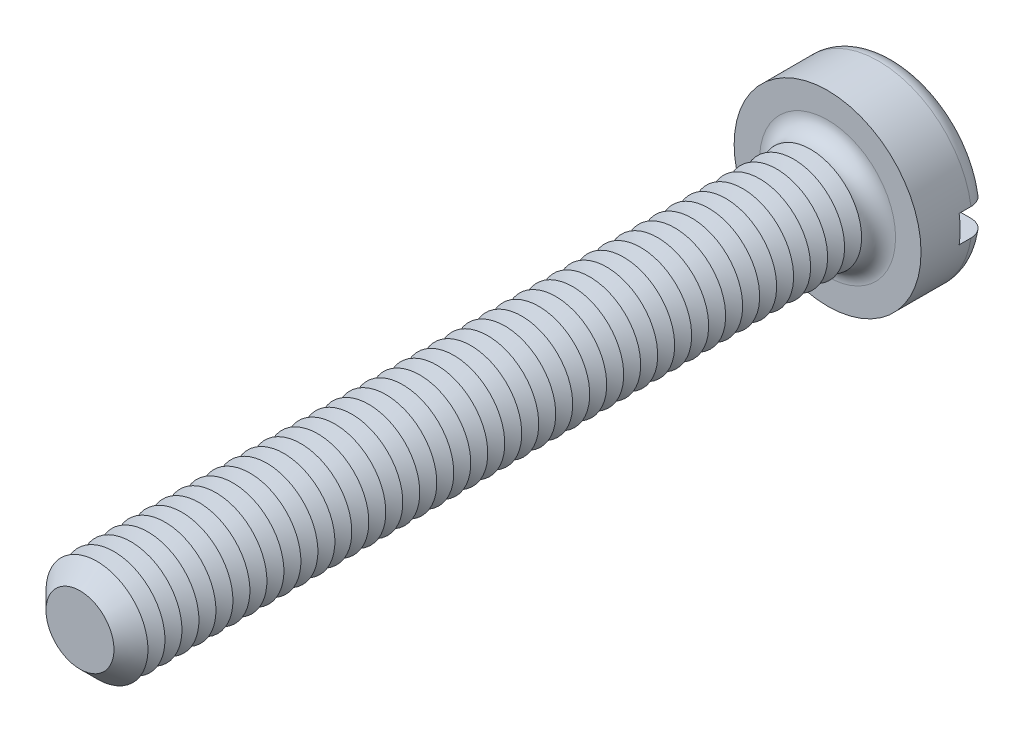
ISO-10303-21;
HEADER;
FILE_DESCRIPTION(('STEP AP214'),'2;1');
FILE_NAME('part.step','',(''),(''),'','','');
FILE_SCHEMA(('AUTOMOTIVE_DESIGN { 1 0 10303 214 1 1 1 1 }'));
ENDSEC;
DATA;
#1=APPLICATION_CONTEXT('core data for automotive mechanical design processes');
#2=APPLICATION_PROTOCOL_DEFINITION('international standard','automotive_design',2000,#1);
#3=PRODUCT_CONTEXT('',#1,'mechanical');
#4=PRODUCT('Part','Part','',(#3));
#5=PRODUCT_RELATED_PRODUCT_CATEGORY('part','',(#4));
#6=PRODUCT_DEFINITION_FORMATION('','',#4);
#7=PRODUCT_DEFINITION_CONTEXT('part definition',#1,'design');
#8=PRODUCT_DEFINITION('design','',#6,#7);
#9=PRODUCT_DEFINITION_SHAPE('','',#8);
#10=(LENGTH_UNIT() NAMED_UNIT(*) SI_UNIT(.MILLI.,.METRE.));
#11=(NAMED_UNIT(*) PLANE_ANGLE_UNIT() SI_UNIT($,.RADIAN.));
#12=(NAMED_UNIT(*) SI_UNIT($,.STERADIAN.) SOLID_ANGLE_UNIT());
#13=UNCERTAINTY_MEASURE_WITH_UNIT(LENGTH_MEASURE(1.E-05),#10,'distance_accuracy_value','');
#14=(GEOMETRIC_REPRESENTATION_CONTEXT(3) GLOBAL_UNCERTAINTY_ASSIGNED_CONTEXT((#13)) GLOBAL_UNIT_ASSIGNED_CONTEXT((#10,
#11,#12)) REPRESENTATION_CONTEXT('',''));
#15=CARTESIAN_POINT('',(0.,0.,0.));
#16=DIRECTION('',(0.,0.,1.));
#17=DIRECTION('',(1.,0.,0.));
#18=AXIS2_PLACEMENT_3D('',#15,#16,#17);
#19=CARTESIAN_POINT('',(0.,0.,-2.));
#20=DIRECTION('',(0.,0.,1.));
#21=DIRECTION('',(1.,0.,0.));
#22=AXIS2_PLACEMENT_3D('',#19,#20,#21);
#23=PLANE('',#22);
#24=CARTESIAN_POINT('',(0.,0.,-2.));
#25=DIRECTION('',(0.,0.,1.));
#26=DIRECTION('',(1.,0.,0.));
#27=AXIS2_PLACEMENT_3D('',#24,#25,#26);
#28=CIRCLE('',#27,2.25);
#29=CARTESIAN_POINT('',(-2.21415898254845,0.4,-2.));
#30=VERTEX_POINT('',#29);
#31=CARTESIAN_POINT('',(2.21415898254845,0.4,-2.));
#32=VERTEX_POINT('',#31);
#33=EDGE_CURVE('E116',#30,#32,#28,.F.);
#34=ORIENTED_EDGE('',*,*,#33,.T.);
#35=DIRECTION('',(1.,0.,0.));
#36=VECTOR('',#35,1.);
#37=CARTESIAN_POINT('',(-2.75,0.400000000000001,-2.));
#38=LINE('',#37,#36);
#39=EDGE_CURVE('E111',#30,#32,#38,.T.);
#40=ORIENTED_EDGE('',*,*,#39,.F.);
#41=EDGE_LOOP('',(#34,#40));
#42=FACE_BOUND('',#41,.T.);
#43=ADVANCED_FACE('F39',(#42),#23,.F.);
#44=CARTESIAN_POINT('',(0.,0.,-1.5));
#45=DIRECTION('',(0.,0.,1.));
#46=DIRECTION('',(1.,0.,0.));
#47=AXIS2_PLACEMENT_3D('',#44,#45,#46);
#48=TOROIDAL_SURFACE('',#47,2.25,0.5);
#49=CARTESIAN_POINT('',(-2.6296588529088,0.400000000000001,-1.78631483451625));
#50=CARTESIAN_POINT('',(-2.61332846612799,0.400000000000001,-1.80942627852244));
#51=CARTESIAN_POINT('',(-2.59501593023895,0.400000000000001,-1.83116426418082));
#52=CARTESIAN_POINT('',(-2.55497423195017,0.400000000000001,-1.87126271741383));
#53=CARTESIAN_POINT('',(-2.53324055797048,0.4,-1.88961865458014));
#54=CARTESIAN_POINT('',(-2.48702796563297,0.4,-1.92241505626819));
#55=CARTESIAN_POINT('',(-2.46255183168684,0.4,-1.93685944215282));
#56=CARTESIAN_POINT('',(-2.41154731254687,0.4,-1.96147315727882));
#57=CARTESIAN_POINT('',(-2.38501943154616,0.4,-1.97164353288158));
#58=CARTESIAN_POINT('',(-2.3303912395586,0.4,-1.98753780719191));
#59=CARTESIAN_POINT('',(-2.30227842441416,0.4,-1.99321871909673));
#60=CARTESIAN_POINT('',(-2.24549884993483,0.4,-1.99984170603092));
#61=CARTESIAN_POINT('',(-2.21683202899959,0.4,-2.00078325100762));
#62=CARTESIAN_POINT('',(-2.15939326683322,0.4,-1.99790249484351));
#63=CARTESIAN_POINT('',(-2.13062419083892,0.4,-1.99402290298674));
#64=CARTESIAN_POINT('',(-2.07413526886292,0.4,-1.98151915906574));
#65=CARTESIAN_POINT('',(-2.04641547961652,0.4,-1.97289475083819));
#66=CARTESIAN_POINT('',(-1.99264697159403,0.4,-1.95107177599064));
#67=CARTESIAN_POINT('',(-1.96660904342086,0.4,-1.93784659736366));
#68=CARTESIAN_POINT('',(-1.91713954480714,0.4,-1.90718730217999));
#69=CARTESIAN_POINT('',(-1.89370795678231,0.4,-1.88975321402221));
#70=CARTESIAN_POINT('',(-1.85029144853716,0.4,-1.85126548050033));
#71=CARTESIAN_POINT('',(-1.83028607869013,0.4,-1.83023492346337));
#72=CARTESIAN_POINT('',(-1.79417432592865,0.4,-1.78505552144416));
#73=CARTESIAN_POINT('',(-1.77806752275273,0.4,-1.76090701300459));
#74=CARTESIAN_POINT('',(-1.75056079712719,0.4,-1.71067721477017));
#75=CARTESIAN_POINT('',(-1.7390748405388,0.4,-1.68464306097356));
#76=CARTESIAN_POINT('',(-1.72075680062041,0.4,-1.63098625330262));
#77=CARTESIAN_POINT('',(-1.71392397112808,0.4,-1.60336385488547));
#78=CARTESIAN_POINT('',(-1.70525661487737,0.4,-1.54801066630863));
#79=CARTESIAN_POINT('',(-1.70330866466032,0.4,-1.52029759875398));
#80=CARTESIAN_POINT('',(-1.70414820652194,0.4,-1.46494458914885));
#81=CARTESIAN_POINT('',(-1.70693532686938,0.4,-1.43730464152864));
#82=CARTESIAN_POINT('',(-1.71709335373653,0.4,-1.38318389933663));
#83=CARTESIAN_POINT('',(-1.72441580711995,0.4,-1.35669397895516));
#84=CARTESIAN_POINT('',(-1.74335830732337,0.4,-1.30529964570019));
#85=CARTESIAN_POINT('',(-1.75497853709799,0.4,-1.2803953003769));
#86=CARTESIAN_POINT('',(-1.78229453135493,0.4,-1.23258298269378));
#87=CARTESIAN_POINT('',(-1.79803217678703,0.4,-1.20969896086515));
#88=CARTESIAN_POINT('',(-1.83304498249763,0.4,-1.16682064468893));
#89=CARTESIAN_POINT('',(-1.85232054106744,0.4,-1.1468266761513));
#90=CARTESIAN_POINT('',(-1.89433695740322,0.4,-1.10980713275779));
#91=CARTESIAN_POINT('',(-1.91714740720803,0.4,-1.09286053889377));
#92=CARTESIAN_POINT('',(-1.96524407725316,0.4,-1.06294809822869));
#93=CARTESIAN_POINT('',(-1.99053056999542,0.4,-1.04998269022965));
#94=CARTESIAN_POINT('',(-2.04340612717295,0.4,-1.02814800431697));
#95=CARTESIAN_POINT('',(-2.07103098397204,0.4,-1.01936532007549));
#96=CARTESIAN_POINT('',(-2.12735840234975,0.4,-1.00652373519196));
#97=CARTESIAN_POINT('',(-2.15606102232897,0.4,-1.00246509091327));
#98=CARTESIAN_POINT('',(-2.21395379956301,0.4,-0.999181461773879));
#99=CARTESIAN_POINT('',(-2.24314598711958,0.4,-0.999992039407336));
#100=CARTESIAN_POINT('',(-2.30097585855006,0.4,-1.00652779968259));
#101=CARTESIAN_POINT('',(-2.32961355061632,0.4,-1.01225290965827));
#102=CARTESIAN_POINT('',(-2.38536238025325,0.4,-1.02843951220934));
#103=CARTESIAN_POINT('',(-2.41248047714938,0.4,-1.03887701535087));
#104=CARTESIAN_POINT('',(-2.46454860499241,0.4,-1.06421009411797));
#105=CARTESIAN_POINT('',(-2.48949875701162,0.4,-1.0791054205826));
#106=CARTESIAN_POINT('',(-2.53620471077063,0.4,-1.11274531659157));
#107=CARTESIAN_POINT('',(-2.55799482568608,0.400000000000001,-1.1314422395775));
#108=CARTESIAN_POINT('',(-2.59807595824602,0.400000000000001,-1.17227176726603));
#109=CARTESIAN_POINT('',(-2.6163672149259,0.400000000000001,-1.19440413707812));
#110=CARTESIAN_POINT('',(-2.64868581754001,0.400000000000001,-1.24117072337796));
#111=CARTESIAN_POINT('',(-2.66276466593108,0.400000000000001,-1.26576935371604));
#112=CARTESIAN_POINT('',(-2.68654482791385,0.400000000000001,-1.31699754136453));
#113=CARTESIAN_POINT('',(-2.69624657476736,0.400000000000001,-1.34362689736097));
#114=CARTESIAN_POINT('',(-2.71090527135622,0.400000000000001,-1.39787706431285));
#115=CARTESIAN_POINT('',(-2.71590826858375,0.400000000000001,-1.4254854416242));
#116=CARTESIAN_POINT('',(-2.72118463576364,0.400000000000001,-1.48115803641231));
#117=CARTESIAN_POINT('',(-2.72145696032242,0.400000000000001,-1.50922235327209));
#118=CARTESIAN_POINT('',(-2.71727180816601,0.400000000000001,-1.56487271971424));
#119=CARTESIAN_POINT('',(-2.71283440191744,0.400000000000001,-1.59246029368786));
#120=CARTESIAN_POINT('',(-2.69939521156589,0.400000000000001,-1.64647499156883));
#121=CARTESIAN_POINT('',(-2.69039909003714,0.400000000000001,-1.67290351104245));
#122=CARTESIAN_POINT('',(-2.67251693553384,0.400000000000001,-1.71382731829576));
#123=CARTESIAN_POINT('',(-2.66497994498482,0.400000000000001,-1.72892686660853));
#124=CARTESIAN_POINT('',(-2.64841616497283,0.400000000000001,-1.75828509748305));
#125=CARTESIAN_POINT('',(-2.63938938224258,0.400000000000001,-1.77254378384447));
#126=CARTESIAN_POINT('',(-2.6296588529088,0.400000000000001,-1.78631483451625));
#127=B_SPLINE_CURVE_WITH_KNOTS('',3,(#49,#50,#51,#52,#53,#54,#55,#56,#57,#58,#59,#60,#61,#62,
#63,#64,#65,#66,#67,#68,#69,#70,#71,#72,#73,#74,#75,#76,#77,#78,#79,#80,#81,#82,#83,#84,#85,#86,
#87,#88,#89,#90,#91,#92,#93,#94,#95,#96,#97,#98,#99,#100,#101,#102,#103,#104,#105,#106,#107,
#108,#109,#110,#111,#112,#113,#114,#115,#116,#117,#118,#119,#120,#121,#122,#123,#124,#125,#126),
.UNSPECIFIED.,.T.,.F.,(4,2,2,2,2,2,2,2,2,2,2,2,2,2,2,2,2,2,2,2,2,2,2,2,2,2,2,2,2,2,2,2,2,2,2,2,
2,2,4),(0.,0.0848338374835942,0.16978050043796,0.254641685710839,0.339482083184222,
0.42512530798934,0.510778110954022,0.597458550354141,0.684143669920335,0.771338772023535,
0.858533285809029,0.945187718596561,1.03183280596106,1.11678035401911,1.20171427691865,
1.28465703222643,1.36759327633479,1.4496584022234,1.53172702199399,1.61466526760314,
1.69761285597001,1.78247103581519,1.86733856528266,1.95389396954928,2.0404540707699,
2.12764713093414,2.21483890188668,2.30159172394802,2.38833969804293,2.4740609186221,
2.55977628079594,2.6443962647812,2.72900787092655,2.81278135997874,2.89657336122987,
2.98000971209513,3.06334267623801,3.113891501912,3.16444009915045),.UNSPECIFIED.);
#128=CARTESIAN_POINT('',(-2.72075357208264,0.400000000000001,-1.50000000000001));
#129=VERTEX_POINT('',#128);
#130=EDGE_CURVE('E515',#129,#30,#127,.T.);
#131=ORIENTED_EDGE('',*,*,#130,.F.);
#132=CARTESIAN_POINT('',(0.,0.,-1.5));
#133=DIRECTION('',(0.,0.,1.));
#134=DIRECTION('',(1.,0.,0.));
#135=AXIS2_PLACEMENT_3D('',#132,#133,#134);
#136=CIRCLE('',#135,2.75);
#137=CARTESIAN_POINT('',(2.7207535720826,0.4,-1.5));
#138=VERTEX_POINT('',#137);
#139=EDGE_CURVE('E125',#138,#129,#136,.T.);
#140=ORIENTED_EDGE('',*,*,#139,.F.);
#141=CARTESIAN_POINT('',(1.7362507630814,0.4,-1.6752840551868));
#142=CARTESIAN_POINT('',(1.74636083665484,0.4,-1.70159961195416));
#143=CARTESIAN_POINT('',(1.7587429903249,0.4,-1.72706707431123));
#144=CARTESIAN_POINT('',(1.78764414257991,0.4,-1.77556609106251));
#145=CARTESIAN_POINT('',(1.80416918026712,0.4,-1.79859401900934));
#146=CARTESIAN_POINT('',(1.84080454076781,0.4,-1.84153587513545));
#147=CARTESIAN_POINT('',(1.86090949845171,0.4,-1.86145438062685));
#148=CARTESIAN_POINT('',(1.9041208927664,0.4,-1.89769607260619));
#149=CARTESIAN_POINT('',(1.92722659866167,0.4,-1.91402013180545));
#150=CARTESIAN_POINT('',(1.97620958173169,0.4,-1.94291288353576));
#151=CARTESIAN_POINT('',(2.00212726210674,0.4,-1.95541309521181));
#152=CARTESIAN_POINT('',(2.05567603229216,0.4,-1.97595143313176));
#153=CARTESIAN_POINT('',(2.08330733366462,0.4,-1.98398900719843));
#154=CARTESIAN_POINT('',(2.13989163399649,0.4,-1.99545904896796));
#155=CARTESIAN_POINT('',(2.16885726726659,0.4,-1.99882930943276));
#156=CARTESIAN_POINT('',(2.22694412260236,0.4,-2.00065872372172));
#157=CARTESIAN_POINT('',(2.25606534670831,0.4,-1.99911781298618));
#158=CARTESIAN_POINT('',(2.31362436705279,0.4,-1.99114818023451));
#159=CARTESIAN_POINT('',(2.34206235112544,0.4,-1.98472081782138));
#160=CARTESIAN_POINT('',(2.39743709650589,0.4,-1.96713601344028));
#161=CARTESIAN_POINT('',(2.42437392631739,0.4,-1.95597878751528));
#162=CARTESIAN_POINT('',(2.47569769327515,0.4,-1.92935960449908));
#163=CARTESIAN_POINT('',(2.50010686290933,0.4,-1.91394052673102));
#164=CARTESIAN_POINT('',(2.54594525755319,0.4,-1.8791725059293));
#165=CARTESIAN_POINT('',(2.56737468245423,0.4,-1.85982382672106));
#166=CARTESIAN_POINT('',(2.60634898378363,0.4,-1.81801641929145));
#167=CARTESIAN_POINT('',(2.6239407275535,0.4,-1.79560138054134));
#168=CARTESIAN_POINT('',(2.65505953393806,0.4,-1.7481077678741));
#169=CARTESIAN_POINT('',(2.66858686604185,0.4,-1.72302937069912));
#170=CARTESIAN_POINT('',(2.69103536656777,0.4,-1.67123055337));
#171=CARTESIAN_POINT('',(2.70000740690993,0.4,-1.64453217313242));
#172=CARTESIAN_POINT('',(2.71330608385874,0.4,-1.59000262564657));
#173=CARTESIAN_POINT('',(2.71763293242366,0.4,-1.5621715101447));
#174=CARTESIAN_POINT('',(2.72149675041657,0.4,-1.50637655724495));
#175=CARTESIAN_POINT('',(2.72106725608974,0.4,-1.47841503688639));
#176=CARTESIAN_POINT('',(2.7155123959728,0.4,-1.42296287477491));
#177=CARTESIAN_POINT('',(2.71038711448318,0.4,-1.39547222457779));
#178=CARTESIAN_POINT('',(2.69560462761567,0.4,-1.34178071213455));
#179=CARTESIAN_POINT('',(2.68595389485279,0.4,-1.31557806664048));
#180=CARTESIAN_POINT('',(2.66240876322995,0.4,-1.26515516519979));
#181=CARTESIAN_POINT('',(2.64851431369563,0.4,-1.24093493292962));
#182=CARTESIAN_POINT('',(2.61681930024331,0.4,-1.19504594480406));
#183=CARTESIAN_POINT('',(2.59900198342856,0.4,-1.17338876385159));
#184=CARTESIAN_POINT('',(2.56001495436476,0.4,-1.13333899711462));
#185=CARTESIAN_POINT('',(2.53884510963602,0.4,-1.11494654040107));
#186=CARTESIAN_POINT('',(2.49354554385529,0.4,-1.08175888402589));
#187=CARTESIAN_POINT('',(2.46938991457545,0.4,-1.06699905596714));
#188=CARTESIAN_POINT('',(2.41896725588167,0.4,-1.04168682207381));
#189=CARTESIAN_POINT('',(2.39270009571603,0.4,-1.03113467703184));
#190=CARTESIAN_POINT('',(2.33844927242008,0.4,-1.01439607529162));
#191=CARTESIAN_POINT('',(2.31044823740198,0.4,-1.00826592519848));
#192=CARTESIAN_POINT('',(2.25381752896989,0.4,-1.00073183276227));
#193=CARTESIAN_POINT('',(2.22518781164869,0.4,-0.999328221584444));
#194=CARTESIAN_POINT('',(2.16774231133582,0.4,-1.00127811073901));
#195=CARTESIAN_POINT('',(2.13892848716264,0.4,-1.00468955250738));
#196=CARTESIAN_POINT('',(2.08227193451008,0.4,-1.01626887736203));
#197=CARTESIAN_POINT('',(2.05442926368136,0.4,-1.02443704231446));
#198=CARTESIAN_POINT('',(2.00032604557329,0.4,-1.04537295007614));
#199=CARTESIAN_POINT('',(1.97407661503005,0.4,-1.05816944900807));
#200=CARTESIAN_POINT('',(1.92411255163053,0.4,-1.08801035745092));
#201=CARTESIAN_POINT('',(1.90039792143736,0.4,-1.10505477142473));
#202=CARTESIAN_POINT('',(1.85633574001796,0.4,-1.14282887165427));
#203=CARTESIAN_POINT('',(1.83597040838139,0.4,-1.16353779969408));
#204=CARTESIAN_POINT('',(1.79908731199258,0.4,-1.20813793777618));
#205=CARTESIAN_POINT('',(1.78256899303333,0.4,-1.23202868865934));
#206=CARTESIAN_POINT('',(1.75420022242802,0.4,-1.28183173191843));
#207=CARTESIAN_POINT('',(1.74226635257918,0.4,-1.30769648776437));
#208=CARTESIAN_POINT('',(1.72302798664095,0.4,-1.36110211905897));
#209=CARTESIAN_POINT('',(1.71572395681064,0.4,-1.38864316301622));
#210=CARTESIAN_POINT('',(1.70611974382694,0.4,-1.44392326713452));
#211=CARTESIAN_POINT('',(1.70370764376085,0.4,-1.47164298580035));
#212=CARTESIAN_POINT('',(1.70363822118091,0.4,-1.52706336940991));
#213=CARTESIAN_POINT('',(1.70597448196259,0.4,-1.55476400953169));
#214=CARTESIAN_POINT('',(1.71335146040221,0.4,-1.59796127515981));
#215=CARTESIAN_POINT('',(1.71686033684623,0.4,-1.61373520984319));
#216=CARTESIAN_POINT('',(1.7254146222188,0.4,-1.64486018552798));
#217=CARTESIAN_POINT('',(1.73045999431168,0.4,-1.66021123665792));
#218=CARTESIAN_POINT('',(1.7362507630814,0.4,-1.6752840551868));
#219=B_SPLINE_CURVE_WITH_KNOTS('',3,(#141,#142,#143,#144,#145,#146,#147,#148,#149,#150,#151,
#152,#153,#154,#155,#156,#157,#158,#159,#160,#161,#162,#163,#164,#165,#166,#167,#168,#169,#170,
#171,#172,#173,#174,#175,#176,#177,#178,#179,#180,#181,#182,#183,#184,#185,#186,#187,#188,#189,
#190,#191,#192,#193,#194,#195,#196,#197,#198,#199,#200,#201,#202,#203,#204,#205,#206,#207,#208,
#209,#210,#211,#212,#213,#214,#215,#216,#217,#218),.UNSPECIFIED.,.T.,.F.,(4,2,2,2,2,2,2,2,2,2,2,
2,2,2,2,2,2,2,2,2,2,2,2,2,2,2,2,2,2,2,2,2,2,2,2,2,2,2,4),(0.,0.0845117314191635,
0.169147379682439,0.253657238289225,0.338146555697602,0.424070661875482,0.510005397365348,
0.597074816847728,0.684145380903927,0.771191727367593,0.858234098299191,0.94443074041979,
1.03062159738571,1.11569223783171,1.20075723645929,1.28485012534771,1.36893917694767,
1.45243570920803,1.53593074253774,1.61930671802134,1.70268368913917,1.7864238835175,
1.87016738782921,1.95469664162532,2.03923113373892,2.12482389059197,2.21042264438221,
2.29706026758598,2.38370302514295,2.47089361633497,2.55808429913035,2.64479602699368,
2.73149525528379,2.81653234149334,2.9015779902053,2.98465497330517,3.06761976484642,
3.11602689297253,3.164432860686),.UNSPECIFIED.);
#220=EDGE_CURVE('E517',#32,#138,#219,.T.);
#221=ORIENTED_EDGE('',*,*,#220,.F.);
#222=ORIENTED_EDGE('',*,*,#33,.F.);
#223=EDGE_LOOP('',(#131,#140,#221,#222));
#224=FACE_BOUND('',#223,.T.);
#225=ADVANCED_FACE('F499',(#224),#48,.T.);
#226=CARTESIAN_POINT('',(0.,0.,-2.));
#227=DIRECTION('',(0.,0.,1.));
#228=DIRECTION('',(1.,0.,0.));
#229=AXIS2_PLACEMENT_3D('',#226,#227,#228);
#230=CYLINDRICAL_SURFACE('',#229,2.75);
#231=DIRECTION('',(0.,0.,1.));
#232=VECTOR('',#231,1.);
#233=CARTESIAN_POINT('',(2.72075357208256,0.4,-2.));
#234=LINE('',#233,#232);
#235=CARTESIAN_POINT('',(2.72075357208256,0.4,-1.15));
#236=VERTEX_POINT('',#235);
#237=EDGE_CURVE('E531',#138,#236,#234,.T.);
#238=ORIENTED_EDGE('',*,*,#237,.F.);
#239=ORIENTED_EDGE('',*,*,#139,.T.);
#240=DIRECTION('',(0.,0.,1.));
#241=VECTOR('',#240,1.);
#242=CARTESIAN_POINT('',(-2.72075357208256,0.4,-2.));
#243=LINE('',#242,#241);
#244=CARTESIAN_POINT('',(-2.72075357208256,0.4,-1.15));
#245=VERTEX_POINT('',#244);
#246=EDGE_CURVE('E63',#245,#129,#243,.F.);
#247=ORIENTED_EDGE('',*,*,#246,.F.);
#248=CARTESIAN_POINT('',(0.,0.,-1.15));
#249=DIRECTION('',(0.,0.,-1.));
#250=DIRECTION('',(-1.,0.,0.));
#251=AXIS2_PLACEMENT_3D('',#248,#249,#250);
#252=CIRCLE('',#251,2.75);
#253=CARTESIAN_POINT('',(-2.72075357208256,-0.4,-1.15));
#254=VERTEX_POINT('',#253);
#255=EDGE_CURVE('E43',#245,#254,#252,.F.);
#256=ORIENTED_EDGE('',*,*,#255,.T.);
#257=DIRECTION('',(0.,0.,1.));
#258=VECTOR('',#257,1.);
#259=CARTESIAN_POINT('',(-2.72075357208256,-0.4,-2.));
#260=LINE('',#259,#258);
#261=CARTESIAN_POINT('',(-2.72075357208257,-0.4,-1.5));
#262=VERTEX_POINT('',#261);
#263=EDGE_CURVE('E528',#262,#254,#260,.T.);
#264=ORIENTED_EDGE('',*,*,#263,.F.);
#265=CARTESIAN_POINT('',(2.72075357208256,-0.4,-1.5));
#266=VERTEX_POINT('',#265);
#267=EDGE_CURVE('E127',#262,#266,#136,.T.);
#268=ORIENTED_EDGE('',*,*,#267,.T.);
#269=DIRECTION('',(0.,0.,1.));
#270=VECTOR('',#269,1.);
#271=CARTESIAN_POINT('',(2.72075357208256,-0.4,-2.));
#272=LINE('',#271,#270);
#273=CARTESIAN_POINT('',(2.72075357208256,-0.4,-1.15));
#274=VERTEX_POINT('',#273);
#275=EDGE_CURVE('E55',#274,#266,#272,.F.);
#276=ORIENTED_EDGE('',*,*,#275,.F.);
#277=EDGE_CURVE('E11',#274,#236,#252,.F.);
#278=ORIENTED_EDGE('',*,*,#277,.T.);
#279=EDGE_LOOP('',(#238,#239,#247,#256,#264,#268,#276,#278));
#280=FACE_BOUND('',#279,.T.);
#281=CARTESIAN_POINT('',(0.,0.,0.));
#282=DIRECTION('',(0.,0.,1.));
#283=DIRECTION('',(1.,0.,0.));
#284=AXIS2_PLACEMENT_3D('',#281,#282,#283);
#285=CIRCLE('',#284,2.75);
#286=CARTESIAN_POINT('',(2.75,0.,0.));
#287=VERTEX_POINT('',#286);
#288=EDGE_CURVE('E534',#287,#287,#285,.T.);
#289=ORIENTED_EDGE('',*,*,#288,.F.);
#290=EDGE_LOOP('',(#289));
#291=FACE_BOUND('',#290,.T.);
#292=ADVANCED_FACE('F495',(#280,#291),#230,.T.);
#293=CARTESIAN_POINT('',(2.21415898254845,-0.4,-2.));
#294=VERTEX_POINT('',#293);
#295=CARTESIAN_POINT('',(-2.21415898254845,-0.4,-2.));
#296=VERTEX_POINT('',#295);
#297=EDGE_CURVE('E109',#294,#296,#28,.F.);
#298=ORIENTED_EDGE('',*,*,#297,.T.);
#299=DIRECTION('',(-1.,0.,0.));
#300=VECTOR('',#299,1.);
#301=CARTESIAN_POINT('',(-2.75,-0.4,-2.));
#302=LINE('',#301,#300);
#303=EDGE_CURVE('E96',#294,#296,#302,.T.);
#304=ORIENTED_EDGE('',*,*,#303,.F.);
#305=EDGE_LOOP('',(#298,#304));
#306=FACE_BOUND('',#305,.T.);
#307=ADVANCED_FACE('F108',(#306),#23,.F.);
#308=CARTESIAN_POINT('',(0.,0.,0.));
#309=DIRECTION('',(0.,0.,1.));
#310=DIRECTION('',(1.,0.,0.));
#311=AXIS2_PLACEMENT_3D('',#308,#309,#310);
#312=PLANE('',#311);
#313=CARTESIAN_POINT('',(0.,0.,0.));
#314=DIRECTION('',(0.,0.,1.));
#315=DIRECTION('',(1.,0.,0.));
#316=AXIS2_PLACEMENT_3D('',#313,#314,#315);
#317=CIRCLE('',#316,2.);
#318=CARTESIAN_POINT('',(2.,0.,0.));
#319=VERTEX_POINT('',#318);
#320=EDGE_CURVE('E115',#319,#319,#317,.F.);
#321=ORIENTED_EDGE('',*,*,#320,.T.);
#322=EDGE_LOOP('',(#321));
#323=FACE_BOUND('',#322,.T.);
#324=ORIENTED_EDGE('',*,*,#288,.T.);
#325=EDGE_LOOP('',(#324));
#326=FACE_BOUND('',#325,.T.);
#327=ADVANCED_FACE('F494',(#323,#326),#312,.T.);
#328=CARTESIAN_POINT('',(-2.6296588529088,-0.4,-1.78631483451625));
#329=CARTESIAN_POINT('',(-2.64575286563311,-0.4,-1.76353353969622));
#330=CARTESIAN_POINT('',(-2.65994473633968,-0.4,-1.73938506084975));
#331=CARTESIAN_POINT('',(-2.68408879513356,-0.4,-1.68903091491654));
#332=CARTESIAN_POINT('',(-2.69403633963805,-0.4,-1.6628230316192));
#333=CARTESIAN_POINT('',(-2.70937899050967,-0.4,-1.60911025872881));
#334=CARTESIAN_POINT('',(-2.71477511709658,-0.4,-1.5816056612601));
#335=CARTESIAN_POINT('',(-2.72085365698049,-0.4,-1.52608718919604));
#336=CARTESIAN_POINT('',(-2.7215371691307,-0.4,-1.49807343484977));
#337=CARTESIAN_POINT('',(-2.71817903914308,-0.4,-1.44242333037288));
#338=CARTESIAN_POINT('',(-2.71415291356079,-0.4,-1.41478604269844));
#339=CARTESIAN_POINT('',(-2.70152104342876,-0.4,-1.36057835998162));
#340=CARTESIAN_POINT('',(-2.69291517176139,-0.4,-1.33400799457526));
#341=CARTESIAN_POINT('',(-2.67137052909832,-0.4,-1.28266198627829));
#342=CARTESIAN_POINT('',(-2.65842829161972,-0.4,-1.25788779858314));
#343=CARTESIAN_POINT('',(-2.62859348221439,-0.4,-1.21084577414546));
#344=CARTESIAN_POINT('',(-2.61170082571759,-0.4,-1.18857799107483));
#345=CARTESIAN_POINT('',(-2.5743351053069,-0.4,-1.1470221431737));
#346=CARTESIAN_POINT('',(-2.55383974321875,-0.4,-1.12775413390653));
#347=CARTESIAN_POINT('',(-2.5099353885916,-0.4,-1.09288845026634));
#348=CARTESIAN_POINT('',(-2.48652625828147,-0.4,-1.07729094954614));
#349=CARTESIAN_POINT('',(-2.43718903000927,-0.4,-1.0500239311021));
#350=CARTESIAN_POINT('',(-2.41123629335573,-0.4,-1.0383990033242));
#351=CARTESIAN_POINT('',(-2.35776417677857,-0.4,-1.01960886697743));
#352=CARTESIAN_POINT('',(-2.33024469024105,-0.4,-1.01244396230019));
#353=CARTESIAN_POINT('',(-2.27404134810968,-0.4,-1.00268156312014));
#354=CARTESIAN_POINT('',(-2.24534705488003,-0.4,-1.00014414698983));
#355=CARTESIAN_POINT('',(-2.18793513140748,-0.4,-0.999867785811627));
#356=CARTESIAN_POINT('',(-2.15921749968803,-0.4,-1.00212917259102));
#357=CARTESIAN_POINT('',(-2.10225052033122,-0.4,-1.01142552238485));
#358=CARTESIAN_POINT('',(-2.07400941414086,-0.4,-1.01851105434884));
#359=CARTESIAN_POINT('',(-2.01911044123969,-0.4,-1.03730994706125));
#360=CARTESIAN_POINT('',(-1.99245264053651,-0.4,-1.04902350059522));
#361=CARTESIAN_POINT('',(-1.94142108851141,-0.4,-1.07679847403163));
#362=CARTESIAN_POINT('',(-1.91705303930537,-0.4,-1.09287038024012));
#363=CARTESIAN_POINT('',(-1.87139758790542,-0.4,-1.12891897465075));
#364=CARTESIAN_POINT('',(-1.85011007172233,-0.4,-1.14889551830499));
#365=CARTESIAN_POINT('',(-1.81149058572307,-0.4,-1.19196940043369));
#366=CARTESIAN_POINT('',(-1.79411779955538,-0.4,-1.21503011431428));
#367=CARTESIAN_POINT('',(-1.76359546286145,-0.4,-1.26379588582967));
#368=CARTESIAN_POINT('',(-1.75044532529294,-0.4,-1.28950057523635));
#369=CARTESIAN_POINT('',(-1.72906221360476,-0.4,-1.3422057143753));
#370=CARTESIAN_POINT('',(-1.72072512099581,-0.4,-1.3691639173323));
#371=CARTESIAN_POINT('',(-1.70880448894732,-0.4,-1.42411084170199));
#372=CARTESIAN_POINT('',(-1.7052202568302,-0.4,-1.45209941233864));
#373=CARTESIAN_POINT('',(-1.70295553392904,-0.4,-1.50768522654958));
#374=CARTESIAN_POINT('',(-1.70417398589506,-0.4,-1.53527840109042));
#375=CARTESIAN_POINT('',(-1.71124536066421,-0.4,-1.58986292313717));
#376=CARTESIAN_POINT('',(-1.71709811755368,-0.4,-1.61685429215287));
#377=CARTESIAN_POINT('',(-1.73321132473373,-0.4,-1.66938107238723));
#378=CARTESIAN_POINT('',(-1.74345625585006,-0.4,-1.69492125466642));
#379=CARTESIAN_POINT('',(-1.76802111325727,-0.4,-1.74395877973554));
#380=CARTESIAN_POINT('',(-1.78234133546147,-0.4,-1.76745597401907));
#381=CARTESIAN_POINT('',(-1.81488631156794,-0.4,-1.81216193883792));
#382=CARTESIAN_POINT('',(-1.83317116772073,-0.4,-1.83332693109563));
#383=CARTESIAN_POINT('',(-1.87296030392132,-0.4,-1.872375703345));
#384=CARTESIAN_POINT('',(-1.89446497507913,-0.4,-1.89025908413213));
#385=CARTESIAN_POINT('',(-1.94063077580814,-0.4,-1.92267732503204));
#386=CARTESIAN_POINT('',(-1.96535444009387,-0.4,-1.93712316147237));
#387=CARTESIAN_POINT('',(-2.01684705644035,-0.4,-1.96173690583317));
#388=CARTESIAN_POINT('',(-2.04361620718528,-0.4,-1.97190439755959));
#389=CARTESIAN_POINT('',(-2.09891021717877,-0.4,-1.9878230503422));
#390=CARTESIAN_POINT('',(-2.12745653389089,-0.4,-1.99349978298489));
#391=CARTESIAN_POINT('',(-2.18509639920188,-0.4,-1.99999556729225));
#392=CARTESIAN_POINT('',(-2.21418994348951,-0.4,-2.00081465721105));
#393=CARTESIAN_POINT('',(-2.27218032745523,-0.4,-1.99755156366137));
#394=CARTESIAN_POINT('',(-2.30107643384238,-0.4,-1.99345627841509));
#395=CARTESIAN_POINT('',(-2.35776697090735,-0.4,-1.98043125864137));
#396=CARTESIAN_POINT('',(-2.38556116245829,-0.4,-1.97150048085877));
#397=CARTESIAN_POINT('',(-2.43901832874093,-0.4,-1.94912081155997));
#398=CARTESIAN_POINT('',(-2.46469578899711,-0.4,-1.93570648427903));
#399=CARTESIAN_POINT('',(-2.51337022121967,-0.4,-1.90471183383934));
#400=CARTESIAN_POINT('',(-2.53637056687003,-0.4,-1.88713684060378));
#401=CARTESIAN_POINT('',(-2.57111030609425,-0.4,-1.85552084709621));
#402=CARTESIAN_POINT('',(-2.58386709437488,-0.4,-1.84257896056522));
#403=CARTESIAN_POINT('',(-2.60790410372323,-0.4,-1.81538935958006));
#404=CARTESIAN_POINT('',(-2.61918433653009,-0.4,-1.80114165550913));
#405=CARTESIAN_POINT('',(-2.6296588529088,-0.4,-1.78631483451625));
#406=B_SPLINE_CURVE_WITH_KNOTS('',3,(#328,#329,#330,#331,#332,#333,#334,#335,#336,#337,#338,
#339,#340,#341,#342,#343,#344,#345,#346,#347,#348,#349,#350,#351,#352,#353,#354,#355,#356,#357,
#358,#359,#360,#361,#362,#363,#364,#365,#366,#367,#368,#369,#370,#371,#372,#373,#374,#375,#376,
#377,#378,#379,#380,#381,#382,#383,#384,#385,#386,#387,#388,#389,#390,#391,#392,#393,#394,#395,
#396,#397,#398,#399,#400,#401,#402,#403,#404,#405),.UNSPECIFIED.,.T.,.F.,(4,2,2,2,2,2,2,2,2,2,2,
2,2,2,2,2,2,2,2,2,2,2,2,2,2,2,2,2,2,2,2,2,2,2,2,2,2,2,4),(0.,0.0836125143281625,
0.167316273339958,0.251001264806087,0.334666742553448,0.418057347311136,0.501450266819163,
0.584910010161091,0.668371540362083,0.752369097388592,0.836370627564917,0.921286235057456,
1.00620762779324,1.09222390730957,1.17824613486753,1.26518425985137,1.35212600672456,
1.43927882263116,1.52642841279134,1.61262232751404,1.69880425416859,1.7830443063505,
1.86727208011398,1.9497371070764,2.03219918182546,2.1143722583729,2.19655130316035,
2.28007615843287,2.36361116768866,2.44911836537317,2.53463387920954,2.62153862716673,
2.70844269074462,2.79557895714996,2.88273403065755,2.96923214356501,3.05562004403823,
3.11003826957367,3.16445606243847),.UNSPECIFIED.);
#407=EDGE_CURVE('E103',#296,#262,#406,.T.);
#408=ORIENTED_EDGE('',*,*,#407,.F.);
#409=ORIENTED_EDGE('',*,*,#297,.F.);
#410=CARTESIAN_POINT('',(1.7362507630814,-0.4,-1.6752840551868));
#411=CARTESIAN_POINT('',(1.72641416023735,-0.4,-1.64967314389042));
#412=CARTESIAN_POINT('',(1.71871480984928,-0.4,-1.62322216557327));
#413=CARTESIAN_POINT('',(1.70786038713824,-0.4,-1.56938399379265));
#414=CARTESIAN_POINT('',(1.70470970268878,-0.4,-1.54199592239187));
#415=CARTESIAN_POINT('',(1.70306971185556,-0.4,-1.48708393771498));
#416=CARTESIAN_POINT('',(1.70457942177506,-0.4,-1.45956005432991));
#417=CARTESIAN_POINT('',(1.71220670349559,-0.4,-1.40516538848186));
#418=CARTESIAN_POINT('',(1.71832341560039,-0.4,-1.3782944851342));
#419=CARTESIAN_POINT('',(1.73494792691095,-0.4,-1.32598312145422));
#420=CARTESIAN_POINT('',(1.74545076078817,-0.4,-1.30054108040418));
#421=CARTESIAN_POINT('',(1.77051013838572,-0.4,-1.25173932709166));
#422=CARTESIAN_POINT('',(1.7850670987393,-0.4,-1.22837982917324));
#423=CARTESIAN_POINT('',(1.81806903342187,-0.4,-1.1839775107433));
#424=CARTESIAN_POINT('',(1.8365752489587,-0.4,-1.16298023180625));
#425=CARTESIAN_POINT('',(1.87677669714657,-0.4,-1.1243010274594));
#426=CARTESIAN_POINT('',(1.89847230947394,-0.4,-1.10661949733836));
#427=CARTESIAN_POINT('',(1.94498854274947,-0.4,-1.07463966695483));
#428=CARTESIAN_POINT('',(1.96987078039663,-0.4,-1.06043095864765));
#429=CARTESIAN_POINT('',(2.02163980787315,-0.4,-1.0363161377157));
#430=CARTESIAN_POINT('',(2.04852678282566,-0.4,-1.02641042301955));
#431=CARTESIAN_POINT('',(2.10400319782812,-0.4,-1.01104128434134));
#432=CARTESIAN_POINT('',(2.13261287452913,-0.4,-1.00565079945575));
#433=CARTESIAN_POINT('',(2.19033179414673,-0.4,-0.999735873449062));
#434=CARTESIAN_POINT('',(2.2194410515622,-0.4,-0.999211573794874));
#435=CARTESIAN_POINT('',(2.27740442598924,-0.4,-1.00306591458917));
#436=CARTESIAN_POINT('',(2.30625777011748,-0.4,-1.00745623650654));
#437=CARTESIAN_POINT('',(2.36280530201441,-0.4,-1.02105937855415));
#438=CARTESIAN_POINT('',(2.39049952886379,-0.4,-1.03027203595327));
#439=CARTESIAN_POINT('',(2.44369359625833,-0.4,-1.05318710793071));
#440=CARTESIAN_POINT('',(2.46920965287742,-0.4,-1.0668518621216));
#441=CARTESIAN_POINT('',(2.51754507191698,-0.4,-1.09832423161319));
#442=CARTESIAN_POINT('',(2.54036461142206,-0.4,-1.11613157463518));
#443=CARTESIAN_POINT('',(2.58234752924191,-0.4,-1.15513986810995));
#444=CARTESIAN_POINT('',(2.601553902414,-0.4,-1.1762945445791));
#445=CARTESIAN_POINT('',(2.63609001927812,-0.4,-1.22156192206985));
#446=CARTESIAN_POINT('',(2.65142002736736,-0.4,-1.24567442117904));
#447=CARTESIAN_POINT('',(2.67757733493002,-0.4,-1.29585881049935));
#448=CARTESIAN_POINT('',(2.68845668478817,-0.4,-1.32190357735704));
#449=CARTESIAN_POINT('',(2.7056478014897,-0.4,-1.375459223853));
#450=CARTESIAN_POINT('',(2.71195980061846,-0.4,-1.40297002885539));
#451=CARTESIAN_POINT('',(2.71979288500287,-0.4,-1.45843707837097));
#452=CARTESIAN_POINT('',(2.72135241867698,-0.4,-1.48638789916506));
#453=CARTESIAN_POINT('',(2.71974298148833,-0.4,-1.54215266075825));
#454=CARTESIAN_POINT('',(2.71657412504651,-0.4,-1.56996660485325));
#455=CARTESIAN_POINT('',(2.70561779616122,-0.4,-1.62459191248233));
#456=CARTESIAN_POINT('',(2.69784258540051,-0.4,-1.65140573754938));
#457=CARTESIAN_POINT('',(2.6779146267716,-0.4,-1.70335337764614));
#458=CARTESIAN_POINT('',(2.66576185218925,-0.4,-1.72848718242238));
#459=CARTESIAN_POINT('',(2.63739107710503,-0.4,-1.77645196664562));
#460=CARTESIAN_POINT('',(2.62116029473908,-0.4,-1.79927538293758));
#461=CARTESIAN_POINT('',(2.58512700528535,-0.4,-1.84190182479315));
#462=CARTESIAN_POINT('',(2.56532438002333,-0.4,-1.86170475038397));
#463=CARTESIAN_POINT('',(2.522535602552,-0.4,-1.89791219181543));
#464=CARTESIAN_POINT('',(2.49952399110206,-0.4,-1.91428661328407));
#465=CARTESIAN_POINT('',(2.45110500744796,-0.4,-1.94299324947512));
#466=CARTESIAN_POINT('',(2.4256974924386,-0.4,-1.95532522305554));
#467=CARTESIAN_POINT('',(2.37288090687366,-0.4,-1.97575769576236));
#468=CARTESIAN_POINT('',(2.34545135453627,-0.4,-1.98380524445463));
#469=CARTESIAN_POINT('',(2.28963821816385,-0.4,-1.99524443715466));
#470=CARTESIAN_POINT('',(2.26125456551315,-0.4,-1.99863574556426));
#471=CARTESIAN_POINT('',(2.20395671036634,-0.4,-2.00070487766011));
#472=CARTESIAN_POINT('',(2.17504033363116,-0.4,-1.99932265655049));
#473=CARTESIAN_POINT('',(2.11784130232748,-0.4,-1.9917648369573));
#474=CARTESIAN_POINT('',(2.08955866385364,-0.4,-1.98558911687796));
#475=CARTESIAN_POINT('',(2.03419451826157,-0.4,-1.96854979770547));
#476=CARTESIAN_POINT('',(2.00712437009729,-0.4,-1.95764925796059));
#477=CARTESIAN_POINT('',(1.95519572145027,-0.4,-1.93144413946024));
#478=CARTESIAN_POINT('',(1.93033780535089,-0.4,-1.91613840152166));
#479=CARTESIAN_POINT('',(1.88362525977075,-0.4,-1.88157419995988));
#480=CARTESIAN_POINT('',(1.86176428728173,-0.4,-1.86232430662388));
#481=CARTESIAN_POINT('',(1.82167218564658,-0.4,-1.82038600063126));
#482=CARTESIAN_POINT('',(1.803436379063,-0.4,-1.7977020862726));
#483=CARTESIAN_POINT('',(1.77700088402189,-0.4,-1.7582526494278));
#484=CARTESIAN_POINT('',(1.7675549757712,-0.4,-1.74230781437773));
#485=CARTESIAN_POINT('',(1.75049861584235,-0.4,-1.70946415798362));
#486=CARTESIAN_POINT('',(1.7428881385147,-0.4,-1.69256534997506));
#487=CARTESIAN_POINT('',(1.7362507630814,-0.4,-1.6752840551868));
#488=B_SPLINE_CURVE_WITH_KNOTS('',3,(#410,#411,#412,#413,#414,#415,#416,#417,#418,#419,#420,
#421,#422,#423,#424,#425,#426,#427,#428,#429,#430,#431,#432,#433,#434,#435,#436,#437,#438,#439,
#440,#441,#442,#443,#444,#445,#446,#447,#448,#449,#450,#451,#452,#453,#454,#455,#456,#457,#458,
#459,#460,#461,#462,#463,#464,#465,#466,#467,#468,#469,#470,#471,#472,#473,#474,#475,#476,#477,
#478,#479,#480,#481,#482,#483,#484,#485,#486,#487),.UNSPECIFIED.,.T.,.F.,(4,2,2,2,2,2,2,2,2,2,2,
2,2,2,2,2,2,2,2,2,2,2,2,2,2,2,2,2,2,2,2,2,2,2,2,2,2,2,4),(0.,0.0822382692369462,
0.164555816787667,0.246855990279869,0.329140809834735,0.411332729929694,0.493533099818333,
0.577115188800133,0.660707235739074,0.746270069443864,0.831840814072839,0.918768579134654,
1.00569887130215,1.09283622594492,1.17997064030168,1.26638632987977,1.35279634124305,
1.43810213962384,1.52340211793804,1.60767384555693,1.69194128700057,1.77552515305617,
1.85910699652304,1.94246734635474,2.02582820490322,2.10945367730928,2.19308191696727,
2.2774160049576,2.36175512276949,2.4471137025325,2.53247843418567,2.61892083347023,
2.70536542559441,2.79249842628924,2.87965437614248,2.96662291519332,3.05347850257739,
3.10897061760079,3.16446195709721),.UNSPECIFIED.);
#489=EDGE_CURVE('E92',#266,#294,#488,.T.);
#490=ORIENTED_EDGE('',*,*,#489,.F.);
#491=ORIENTED_EDGE('',*,*,#267,.F.);
#492=EDGE_LOOP('',(#408,#409,#490,#491));
#493=FACE_BOUND('',#492,.T.);
#494=ADVANCED_FACE('F113',(#493),#48,.T.);
#495=CARTESIAN_POINT('',(0.,0.,0.5));
#496=DIRECTION('',(0.,0.,1.));
#497=DIRECTION('',(1.,0.,0.));
#498=AXIS2_PLACEMENT_3D('',#495,#496,#497);
#499=TOROIDAL_SURFACE('',#498,2.,0.5);
#500=ORIENTED_EDGE('',*,*,#320,.F.);
#501=EDGE_LOOP('',(#500));
#502=FACE_BOUND('',#501,.T.);
#503=CARTESIAN_POINT('',(0.,0.,0.5));
#504=DIRECTION('',(0.,0.,-1.));
#505=DIRECTION('',(-1.,0.,0.));
#506=AXIS2_PLACEMENT_3D('',#503,#504,#505);
#507=CIRCLE('',#506,1.5);
#508=CARTESIAN_POINT('',(-1.5,0.,0.5));
#509=VERTEX_POINT('',#508);
#510=EDGE_CURVE('E540',#509,#509,#507,.T.);
#511=ORIENTED_EDGE('',*,*,#510,.T.);
#512=EDGE_LOOP('',(#511));
#513=FACE_BOUND('',#512,.T.);
#514=ADVANCED_FACE('F487',(#502,#513),#499,.F.);
#515=CARTESIAN_POINT('',(0.,0.,0.750000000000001));
#516=DIRECTION('',(0.,0.,-1.));
#517=DIRECTION('',(-1.,0.,0.));
#518=AXIS2_PLACEMENT_3D('',#515,#516,#517);
#519=CONICAL_SURFACE('',#518,1.06698729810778,1.0471975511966);
#520=ORIENTED_EDGE('',*,*,#510,.F.);
#521=EDGE_LOOP('',(#520));
#522=FACE_BOUND('',#521,.T.);
#523=CARTESIAN_POINT('',(0.,0.,0.750000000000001));
#524=DIRECTION('',(0.,0.,-1.));
#525=DIRECTION('',(-1.,0.,0.));
#526=AXIS2_PLACEMENT_3D('',#523,#524,#525);
#527=CIRCLE('',#526,1.06698729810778);
#528=CARTESIAN_POINT('',(-1.06698729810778,0.,0.750000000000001));
#529=VERTEX_POINT('',#528);
#530=EDGE_CURVE('E547',#529,#529,#527,.T.);
#531=ORIENTED_EDGE('',*,*,#530,.T.);
#532=EDGE_LOOP('',(#531));
#533=FACE_BOUND('',#532,.T.);
#534=ADVANCED_FACE('F483',(#522,#533),#519,.T.);
#535=CARTESIAN_POINT('',(0.,0.,1.));
#536=DIRECTION('',(0.,0.,1.));
#537=DIRECTION('',(1.,0.,0.));
#538=AXIS2_PLACEMENT_3D('',#535,#536,#537);
#539=CONICAL_SURFACE('',#538,1.5,1.0471975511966);
#540=ORIENTED_EDGE('',*,*,#530,.F.);
#541=EDGE_LOOP('',(#540));
#542=FACE_BOUND('',#541,.T.);
#543=CARTESIAN_POINT('',(0.,0.,1.));
#544=DIRECTION('',(0.,0.,-1.));
#545=DIRECTION('',(-1.,0.,0.));
#546=AXIS2_PLACEMENT_3D('',#543,#544,#545);
#547=CIRCLE('',#546,1.5);
#548=CARTESIAN_POINT('',(-1.5,0.,1.));
#549=VERTEX_POINT('',#548);
#550=EDGE_CURVE('E553',#549,#549,#547,.T.);
#551=ORIENTED_EDGE('',*,*,#550,.T.);
#552=EDGE_LOOP('',(#551));
#553=FACE_BOUND('',#552,.T.);
#554=ADVANCED_FACE('F479',(#542,#553),#539,.T.);
#555=CARTESIAN_POINT('',(0.,0.,1.25));
#556=DIRECTION('',(0.,0.,-1.));
#557=DIRECTION('',(-1.,0.,0.));
#558=AXIS2_PLACEMENT_3D('',#555,#556,#557);
#559=CONICAL_SURFACE('',#558,1.06698729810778,1.0471975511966);
#560=ORIENTED_EDGE('',*,*,#550,.F.);
#561=EDGE_LOOP('',(#560));
#562=FACE_BOUND('',#561,.T.);
#563=CARTESIAN_POINT('',(0.,0.,1.25));
#564=DIRECTION('',(0.,0.,-1.));
#565=DIRECTION('',(-1.,0.,0.));
#566=AXIS2_PLACEMENT_3D('',#563,#564,#565);
#567=CIRCLE('',#566,1.06698729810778);
#568=CARTESIAN_POINT('',(-1.06698729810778,0.,1.25));
#569=VERTEX_POINT('',#568);
#570=EDGE_CURVE('E557',#569,#569,#567,.T.);
#571=ORIENTED_EDGE('',*,*,#570,.T.);
#572=EDGE_LOOP('',(#571));
#573=FACE_BOUND('',#572,.T.);
#574=ADVANCED_FACE('F475',(#562,#573),#559,.T.);
#575=CARTESIAN_POINT('',(0.,0.,1.5));
#576=DIRECTION('',(0.,0.,1.));
#577=DIRECTION('',(1.,0.,0.));
#578=AXIS2_PLACEMENT_3D('',#575,#576,#577);
#579=CONICAL_SURFACE('',#578,1.5,1.0471975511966);
#580=ORIENTED_EDGE('',*,*,#570,.F.);
#581=EDGE_LOOP('',(#580));
#582=FACE_BOUND('',#581,.T.);
#583=CARTESIAN_POINT('',(0.,0.,1.5));
#584=DIRECTION('',(0.,0.,-1.));
#585=DIRECTION('',(-1.,0.,0.));
#586=AXIS2_PLACEMENT_3D('',#583,#584,#585);
#587=CIRCLE('',#586,1.5);
#588=CARTESIAN_POINT('',(-1.5,0.,1.5));
#589=VERTEX_POINT('',#588);
#590=EDGE_CURVE('E560',#589,#589,#587,.T.);
#591=ORIENTED_EDGE('',*,*,#590,.T.);
#592=EDGE_LOOP('',(#591));
#593=FACE_BOUND('',#592,.T.);
#594=ADVANCED_FACE('F471',(#582,#593),#579,.T.);
#595=CARTESIAN_POINT('',(0.,0.,1.75));
#596=DIRECTION('',(0.,0.,-1.));
#597=DIRECTION('',(-1.,0.,0.));
#598=AXIS2_PLACEMENT_3D('',#595,#596,#597);
#599=CONICAL_SURFACE('',#598,1.06698729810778,1.0471975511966);
#600=ORIENTED_EDGE('',*,*,#590,.F.);
#601=EDGE_LOOP('',(#600));
#602=FACE_BOUND('',#601,.T.);
#603=CARTESIAN_POINT('',(0.,0.,1.75));
#604=DIRECTION('',(0.,0.,-1.));
#605=DIRECTION('',(-1.,0.,0.));
#606=AXIS2_PLACEMENT_3D('',#603,#604,#605);
#607=CIRCLE('',#606,1.06698729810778);
#608=CARTESIAN_POINT('',(-1.06698729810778,0.,1.75));
#609=VERTEX_POINT('',#608);
#610=EDGE_CURVE('E564',#609,#609,#607,.T.);
#611=ORIENTED_EDGE('',*,*,#610,.T.);
#612=EDGE_LOOP('',(#611));
#613=FACE_BOUND('',#612,.T.);
#614=ADVANCED_FACE('F467',(#602,#613),#599,.T.);
#615=CARTESIAN_POINT('',(0.,0.,2.));
#616=DIRECTION('',(0.,0.,1.));
#617=DIRECTION('',(1.,0.,0.));
#618=AXIS2_PLACEMENT_3D('',#615,#616,#617);
#619=CONICAL_SURFACE('',#618,1.5,1.0471975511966);
#620=ORIENTED_EDGE('',*,*,#610,.F.);
#621=EDGE_LOOP('',(#620));
#622=FACE_BOUND('',#621,.T.);
#623=CARTESIAN_POINT('',(0.,0.,2.));
#624=DIRECTION('',(0.,0.,-1.));
#625=DIRECTION('',(-1.,0.,0.));
#626=AXIS2_PLACEMENT_3D('',#623,#624,#625);
#627=CIRCLE('',#626,1.5);
#628=CARTESIAN_POINT('',(-1.5,0.,2.));
#629=VERTEX_POINT('',#628);
#630=EDGE_CURVE('E568',#629,#629,#627,.T.);
#631=ORIENTED_EDGE('',*,*,#630,.T.);
#632=EDGE_LOOP('',(#631));
#633=FACE_BOUND('',#632,.T.);
#634=ADVANCED_FACE('F463',(#622,#633),#619,.T.);
#635=CARTESIAN_POINT('',(0.,0.,2.25));
#636=DIRECTION('',(0.,0.,-1.));
#637=DIRECTION('',(-1.,0.,0.));
#638=AXIS2_PLACEMENT_3D('',#635,#636,#637);
#639=CONICAL_SURFACE('',#638,1.06698729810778,1.0471975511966);
#640=ORIENTED_EDGE('',*,*,#630,.F.);
#641=EDGE_LOOP('',(#640));
#642=FACE_BOUND('',#641,.T.);
#643=CARTESIAN_POINT('',(0.,0.,2.25));
#644=DIRECTION('',(0.,0.,-1.));
#645=DIRECTION('',(-1.,0.,0.));
#646=AXIS2_PLACEMENT_3D('',#643,#644,#645);
#647=CIRCLE('',#646,1.06698729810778);
#648=CARTESIAN_POINT('',(-1.06698729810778,0.,2.25));
#649=VERTEX_POINT('',#648);
#650=EDGE_CURVE('E571',#649,#649,#647,.T.);
#651=ORIENTED_EDGE('',*,*,#650,.T.);
#652=EDGE_LOOP('',(#651));
#653=FACE_BOUND('',#652,.T.);
#654=ADVANCED_FACE('F459',(#642,#653),#639,.T.);
#655=CARTESIAN_POINT('',(0.,0.,2.5));
#656=DIRECTION('',(0.,0.,1.));
#657=DIRECTION('',(1.,0.,0.));
#658=AXIS2_PLACEMENT_3D('',#655,#656,#657);
#659=CONICAL_SURFACE('',#658,1.5,1.0471975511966);
#660=ORIENTED_EDGE('',*,*,#650,.F.);
#661=EDGE_LOOP('',(#660));
#662=FACE_BOUND('',#661,.T.);
#663=CARTESIAN_POINT('',(0.,0.,2.5));
#664=DIRECTION('',(0.,0.,-1.));
#665=DIRECTION('',(-1.,0.,0.));
#666=AXIS2_PLACEMENT_3D('',#663,#664,#665);
#667=CIRCLE('',#666,1.5);
#668=CARTESIAN_POINT('',(-1.5,0.,2.5));
#669=VERTEX_POINT('',#668);
#670=EDGE_CURVE('E574',#669,#669,#667,.T.);
#671=ORIENTED_EDGE('',*,*,#670,.T.);
#672=EDGE_LOOP('',(#671));
#673=FACE_BOUND('',#672,.T.);
#674=ADVANCED_FACE('F455',(#662,#673),#659,.T.);
#675=CARTESIAN_POINT('',(0.,0.,2.75));
#676=DIRECTION('',(0.,0.,-1.));
#677=DIRECTION('',(-1.,0.,0.));
#678=AXIS2_PLACEMENT_3D('',#675,#676,#677);
#679=CONICAL_SURFACE('',#678,1.06698729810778,1.0471975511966);
#680=ORIENTED_EDGE('',*,*,#670,.F.);
#681=EDGE_LOOP('',(#680));
#682=FACE_BOUND('',#681,.T.);
#683=CARTESIAN_POINT('',(0.,0.,2.75));
#684=DIRECTION('',(0.,0.,-1.));
#685=DIRECTION('',(-1.,0.,0.));
#686=AXIS2_PLACEMENT_3D('',#683,#684,#685);
#687=CIRCLE('',#686,1.06698729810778);
#688=CARTESIAN_POINT('',(-1.06698729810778,0.,2.75));
#689=VERTEX_POINT('',#688);
#690=EDGE_CURVE('E578',#689,#689,#687,.T.);
#691=ORIENTED_EDGE('',*,*,#690,.T.);
#692=EDGE_LOOP('',(#691));
#693=FACE_BOUND('',#692,.T.);
#694=ADVANCED_FACE('F451',(#682,#693),#679,.T.);
#695=CARTESIAN_POINT('',(0.,0.,3.));
#696=DIRECTION('',(0.,0.,1.));
#697=DIRECTION('',(1.,0.,0.));
#698=AXIS2_PLACEMENT_3D('',#695,#696,#697);
#699=CONICAL_SURFACE('',#698,1.5,1.0471975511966);
#700=ORIENTED_EDGE('',*,*,#690,.F.);
#701=EDGE_LOOP('',(#700));
#702=FACE_BOUND('',#701,.T.);
#703=CARTESIAN_POINT('',(0.,0.,3.));
#704=DIRECTION('',(0.,0.,-1.));
#705=DIRECTION('',(-1.,0.,0.));
#706=AXIS2_PLACEMENT_3D('',#703,#704,#705);
#707=CIRCLE('',#706,1.5);
#708=CARTESIAN_POINT('',(-1.5,0.,3.));
#709=VERTEX_POINT('',#708);
#710=EDGE_CURVE('E582',#709,#709,#707,.T.);
#711=ORIENTED_EDGE('',*,*,#710,.T.);
#712=EDGE_LOOP('',(#711));
#713=FACE_BOUND('',#712,.T.);
#714=ADVANCED_FACE('F447',(#702,#713),#699,.T.);
#715=CARTESIAN_POINT('',(0.,0.,3.25));
#716=DIRECTION('',(0.,0.,-1.));
#717=DIRECTION('',(-1.,0.,0.));
#718=AXIS2_PLACEMENT_3D('',#715,#716,#717);
#719=CONICAL_SURFACE('',#718,1.06698729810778,1.0471975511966);
#720=ORIENTED_EDGE('',*,*,#710,.F.);
#721=EDGE_LOOP('',(#720));
#722=FACE_BOUND('',#721,.T.);
#723=CARTESIAN_POINT('',(0.,0.,3.25));
#724=DIRECTION('',(0.,0.,-1.));
#725=DIRECTION('',(-1.,0.,0.));
#726=AXIS2_PLACEMENT_3D('',#723,#724,#725);
#727=CIRCLE('',#726,1.06698729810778);
#728=CARTESIAN_POINT('',(-1.06698729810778,0.,3.25));
#729=VERTEX_POINT('',#728);
#730=EDGE_CURVE('E586',#729,#729,#727,.T.);
#731=ORIENTED_EDGE('',*,*,#730,.T.);
#732=EDGE_LOOP('',(#731));
#733=FACE_BOUND('',#732,.T.);
#734=ADVANCED_FACE('F443',(#722,#733),#719,.T.);
#735=CARTESIAN_POINT('',(0.,0.,3.5));
#736=DIRECTION('',(0.,0.,1.));
#737=DIRECTION('',(1.,0.,0.));
#738=AXIS2_PLACEMENT_3D('',#735,#736,#737);
#739=CONICAL_SURFACE('',#738,1.5,1.0471975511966);
#740=ORIENTED_EDGE('',*,*,#730,.F.);
#741=EDGE_LOOP('',(#740));
#742=FACE_BOUND('',#741,.T.);
#743=CARTESIAN_POINT('',(0.,0.,3.5));
#744=DIRECTION('',(0.,0.,-1.));
#745=DIRECTION('',(-1.,0.,0.));
#746=AXIS2_PLACEMENT_3D('',#743,#744,#745);
#747=CIRCLE('',#746,1.5);
#748=CARTESIAN_POINT('',(-1.5,0.,3.5));
#749=VERTEX_POINT('',#748);
#750=EDGE_CURVE('E590',#749,#749,#747,.T.);
#751=ORIENTED_EDGE('',*,*,#750,.T.);
#752=EDGE_LOOP('',(#751));
#753=FACE_BOUND('',#752,.T.);
#754=ADVANCED_FACE('F439',(#742,#753),#739,.T.);
#755=CARTESIAN_POINT('',(0.,0.,3.75));
#756=DIRECTION('',(0.,0.,-1.));
#757=DIRECTION('',(-1.,0.,0.));
#758=AXIS2_PLACEMENT_3D('',#755,#756,#757);
#759=CONICAL_SURFACE('',#758,1.06698729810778,1.0471975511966);
#760=ORIENTED_EDGE('',*,*,#750,.F.);
#761=EDGE_LOOP('',(#760));
#762=FACE_BOUND('',#761,.T.);
#763=CARTESIAN_POINT('',(0.,0.,3.75));
#764=DIRECTION('',(0.,0.,-1.));
#765=DIRECTION('',(-1.,0.,0.));
#766=AXIS2_PLACEMENT_3D('',#763,#764,#765);
#767=CIRCLE('',#766,1.06698729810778);
#768=CARTESIAN_POINT('',(-1.06698729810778,0.,3.75));
#769=VERTEX_POINT('',#768);
#770=EDGE_CURVE('E594',#769,#769,#767,.T.);
#771=ORIENTED_EDGE('',*,*,#770,.T.);
#772=EDGE_LOOP('',(#771));
#773=FACE_BOUND('',#772,.T.);
#774=ADVANCED_FACE('F435',(#762,#773),#759,.T.);
#775=CARTESIAN_POINT('',(0.,0.,4.));
#776=DIRECTION('',(0.,0.,1.));
#777=DIRECTION('',(1.,0.,0.));
#778=AXIS2_PLACEMENT_3D('',#775,#776,#777);
#779=CONICAL_SURFACE('',#778,1.5,1.0471975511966);
#780=ORIENTED_EDGE('',*,*,#770,.F.);
#781=EDGE_LOOP('',(#780));
#782=FACE_BOUND('',#781,.T.);
#783=CARTESIAN_POINT('',(0.,0.,4.));
#784=DIRECTION('',(0.,0.,-1.));
#785=DIRECTION('',(-1.,0.,0.));
#786=AXIS2_PLACEMENT_3D('',#783,#784,#785);
#787=CIRCLE('',#786,1.5);
#788=CARTESIAN_POINT('',(-1.5,0.,4.));
#789=VERTEX_POINT('',#788);
#790=EDGE_CURVE('E598',#789,#789,#787,.T.);
#791=ORIENTED_EDGE('',*,*,#790,.T.);
#792=EDGE_LOOP('',(#791));
#793=FACE_BOUND('',#792,.T.);
#794=ADVANCED_FACE('F431',(#782,#793),#779,.T.);
#795=CARTESIAN_POINT('',(0.,0.,4.25));
#796=DIRECTION('',(0.,0.,-1.));
#797=DIRECTION('',(-1.,0.,0.));
#798=AXIS2_PLACEMENT_3D('',#795,#796,#797);
#799=CONICAL_SURFACE('',#798,1.06698729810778,1.0471975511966);
#800=ORIENTED_EDGE('',*,*,#790,.F.);
#801=EDGE_LOOP('',(#800));
#802=FACE_BOUND('',#801,.T.);
#803=CARTESIAN_POINT('',(0.,0.,4.25));
#804=DIRECTION('',(0.,0.,-1.));
#805=DIRECTION('',(-1.,0.,0.));
#806=AXIS2_PLACEMENT_3D('',#803,#804,#805);
#807=CIRCLE('',#806,1.06698729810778);
#808=CARTESIAN_POINT('',(-1.06698729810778,0.,4.25));
#809=VERTEX_POINT('',#808);
#810=EDGE_CURVE('E602',#809,#809,#807,.T.);
#811=ORIENTED_EDGE('',*,*,#810,.T.);
#812=EDGE_LOOP('',(#811));
#813=FACE_BOUND('',#812,.T.);
#814=ADVANCED_FACE('F427',(#802,#813),#799,.T.);
#815=CARTESIAN_POINT('',(0.,0.,4.5));
#816=DIRECTION('',(0.,0.,1.));
#817=DIRECTION('',(1.,0.,0.));
#818=AXIS2_PLACEMENT_3D('',#815,#816,#817);
#819=CONICAL_SURFACE('',#818,1.5,1.0471975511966);
#820=ORIENTED_EDGE('',*,*,#810,.F.);
#821=EDGE_LOOP('',(#820));
#822=FACE_BOUND('',#821,.T.);
#823=CARTESIAN_POINT('',(0.,0.,4.5));
#824=DIRECTION('',(0.,0.,-1.));
#825=DIRECTION('',(-1.,0.,0.));
#826=AXIS2_PLACEMENT_3D('',#823,#824,#825);
#827=CIRCLE('',#826,1.5);
#828=CARTESIAN_POINT('',(-1.5,0.,4.5));
#829=VERTEX_POINT('',#828);
#830=EDGE_CURVE('E606',#829,#829,#827,.T.);
#831=ORIENTED_EDGE('',*,*,#830,.T.);
#832=EDGE_LOOP('',(#831));
#833=FACE_BOUND('',#832,.T.);
#834=ADVANCED_FACE('F423',(#822,#833),#819,.T.);
#835=CARTESIAN_POINT('',(0.,0.,4.75));
#836=DIRECTION('',(0.,0.,-1.));
#837=DIRECTION('',(-1.,0.,0.));
#838=AXIS2_PLACEMENT_3D('',#835,#836,#837);
#839=CONICAL_SURFACE('',#838,1.06698729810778,1.0471975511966);
#840=ORIENTED_EDGE('',*,*,#830,.F.);
#841=EDGE_LOOP('',(#840));
#842=FACE_BOUND('',#841,.T.);
#843=CARTESIAN_POINT('',(0.,0.,4.75));
#844=DIRECTION('',(0.,0.,-1.));
#845=DIRECTION('',(-1.,0.,0.));
#846=AXIS2_PLACEMENT_3D('',#843,#844,#845);
#847=CIRCLE('',#846,1.06698729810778);
#848=CARTESIAN_POINT('',(-1.06698729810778,0.,4.75));
#849=VERTEX_POINT('',#848);
#850=EDGE_CURVE('E610',#849,#849,#847,.T.);
#851=ORIENTED_EDGE('',*,*,#850,.T.);
#852=EDGE_LOOP('',(#851));
#853=FACE_BOUND('',#852,.T.);
#854=ADVANCED_FACE('F419',(#842,#853),#839,.T.);
#855=CARTESIAN_POINT('',(0.,0.,5.));
#856=DIRECTION('',(0.,0.,1.));
#857=DIRECTION('',(1.,0.,0.));
#858=AXIS2_PLACEMENT_3D('',#855,#856,#857);
#859=CONICAL_SURFACE('',#858,1.5,1.0471975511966);
#860=ORIENTED_EDGE('',*,*,#850,.F.);
#861=EDGE_LOOP('',(#860));
#862=FACE_BOUND('',#861,.T.);
#863=CARTESIAN_POINT('',(0.,0.,5.));
#864=DIRECTION('',(0.,0.,-1.));
#865=DIRECTION('',(-1.,0.,0.));
#866=AXIS2_PLACEMENT_3D('',#863,#864,#865);
#867=CIRCLE('',#866,1.5);
#868=CARTESIAN_POINT('',(-1.5,0.,5.));
#869=VERTEX_POINT('',#868);
#870=EDGE_CURVE('E614',#869,#869,#867,.T.);
#871=ORIENTED_EDGE('',*,*,#870,.T.);
#872=EDGE_LOOP('',(#871));
#873=FACE_BOUND('',#872,.T.);
#874=ADVANCED_FACE('F415',(#862,#873),#859,.T.);
#875=CARTESIAN_POINT('',(0.,0.,5.25));
#876=DIRECTION('',(0.,0.,-1.));
#877=DIRECTION('',(-1.,0.,0.));
#878=AXIS2_PLACEMENT_3D('',#875,#876,#877);
#879=CONICAL_SURFACE('',#878,1.06698729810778,1.0471975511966);
#880=ORIENTED_EDGE('',*,*,#870,.F.);
#881=EDGE_LOOP('',(#880));
#882=FACE_BOUND('',#881,.T.);
#883=CARTESIAN_POINT('',(0.,0.,5.25));
#884=DIRECTION('',(0.,0.,-1.));
#885=DIRECTION('',(-1.,0.,0.));
#886=AXIS2_PLACEMENT_3D('',#883,#884,#885);
#887=CIRCLE('',#886,1.06698729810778);
#888=CARTESIAN_POINT('',(-1.06698729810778,0.,5.25));
#889=VERTEX_POINT('',#888);
#890=EDGE_CURVE('E618',#889,#889,#887,.T.);
#891=ORIENTED_EDGE('',*,*,#890,.T.);
#892=EDGE_LOOP('',(#891));
#893=FACE_BOUND('',#892,.T.);
#894=ADVANCED_FACE('F411',(#882,#893),#879,.T.);
#895=CARTESIAN_POINT('',(0.,0.,5.5));
#896=DIRECTION('',(0.,0.,1.));
#897=DIRECTION('',(1.,0.,0.));
#898=AXIS2_PLACEMENT_3D('',#895,#896,#897);
#899=CONICAL_SURFACE('',#898,1.5,1.0471975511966);
#900=ORIENTED_EDGE('',*,*,#890,.F.);
#901=EDGE_LOOP('',(#900));
#902=FACE_BOUND('',#901,.T.);
#903=CARTESIAN_POINT('',(0.,0.,5.5));
#904=DIRECTION('',(0.,0.,-1.));
#905=DIRECTION('',(-1.,0.,0.));
#906=AXIS2_PLACEMENT_3D('',#903,#904,#905);
#907=CIRCLE('',#906,1.5);
#908=CARTESIAN_POINT('',(-1.5,0.,5.5));
#909=VERTEX_POINT('',#908);
#910=EDGE_CURVE('E622',#909,#909,#907,.T.);
#911=ORIENTED_EDGE('',*,*,#910,.T.);
#912=EDGE_LOOP('',(#911));
#913=FACE_BOUND('',#912,.T.);
#914=ADVANCED_FACE('F407',(#902,#913),#899,.T.);
#915=CARTESIAN_POINT('',(0.,0.,5.75));
#916=DIRECTION('',(0.,0.,-1.));
#917=DIRECTION('',(-1.,0.,0.));
#918=AXIS2_PLACEMENT_3D('',#915,#916,#917);
#919=CONICAL_SURFACE('',#918,1.06698729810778,1.0471975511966);
#920=ORIENTED_EDGE('',*,*,#910,.F.);
#921=EDGE_LOOP('',(#920));
#922=FACE_BOUND('',#921,.T.);
#923=CARTESIAN_POINT('',(0.,0.,5.75));
#924=DIRECTION('',(0.,0.,-1.));
#925=DIRECTION('',(-1.,0.,0.));
#926=AXIS2_PLACEMENT_3D('',#923,#924,#925);
#927=CIRCLE('',#926,1.06698729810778);
#928=CARTESIAN_POINT('',(-1.06698729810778,0.,5.75));
#929=VERTEX_POINT('',#928);
#930=EDGE_CURVE('E625',#929,#929,#927,.T.);
#931=ORIENTED_EDGE('',*,*,#930,.T.);
#932=EDGE_LOOP('',(#931));
#933=FACE_BOUND('',#932,.T.);
#934=ADVANCED_FACE('F403',(#922,#933),#919,.T.);
#935=CARTESIAN_POINT('',(0.,0.,6.));
#936=DIRECTION('',(0.,0.,1.));
#937=DIRECTION('',(1.,0.,0.));
#938=AXIS2_PLACEMENT_3D('',#935,#936,#937);
#939=CONICAL_SURFACE('',#938,1.5,1.0471975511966);
#940=ORIENTED_EDGE('',*,*,#930,.F.);
#941=EDGE_LOOP('',(#940));
#942=FACE_BOUND('',#941,.T.);
#943=CARTESIAN_POINT('',(0.,0.,6.));
#944=DIRECTION('',(0.,0.,-1.));
#945=DIRECTION('',(-1.,0.,0.));
#946=AXIS2_PLACEMENT_3D('',#943,#944,#945);
#947=CIRCLE('',#946,1.5);
#948=CARTESIAN_POINT('',(-1.5,0.,6.));
#949=VERTEX_POINT('',#948);
#950=EDGE_CURVE('E629',#949,#949,#947,.T.);
#951=ORIENTED_EDGE('',*,*,#950,.T.);
#952=EDGE_LOOP('',(#951));
#953=FACE_BOUND('',#952,.T.);
#954=ADVANCED_FACE('F399',(#942,#953),#939,.T.);
#955=CARTESIAN_POINT('',(0.,0.,6.25));
#956=DIRECTION('',(0.,0.,-1.));
#957=DIRECTION('',(-1.,0.,0.));
#958=AXIS2_PLACEMENT_3D('',#955,#956,#957);
#959=CONICAL_SURFACE('',#958,1.06698729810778,1.0471975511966);
#960=ORIENTED_EDGE('',*,*,#950,.F.);
#961=EDGE_LOOP('',(#960));
#962=FACE_BOUND('',#961,.T.);
#963=CARTESIAN_POINT('',(0.,0.,6.25));
#964=DIRECTION('',(0.,0.,-1.));
#965=DIRECTION('',(-1.,0.,0.));
#966=AXIS2_PLACEMENT_3D('',#963,#964,#965);
#967=CIRCLE('',#966,1.06698729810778);
#968=CARTESIAN_POINT('',(-1.06698729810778,0.,6.25));
#969=VERTEX_POINT('',#968);
#970=EDGE_CURVE('E633',#969,#969,#967,.T.);
#971=ORIENTED_EDGE('',*,*,#970,.T.);
#972=EDGE_LOOP('',(#971));
#973=FACE_BOUND('',#972,.T.);
#974=ADVANCED_FACE('F395',(#962,#973),#959,.T.);
#975=CARTESIAN_POINT('',(0.,0.,6.5));
#976=DIRECTION('',(0.,0.,1.));
#977=DIRECTION('',(1.,0.,0.));
#978=AXIS2_PLACEMENT_3D('',#975,#976,#977);
#979=CONICAL_SURFACE('',#978,1.5,1.0471975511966);
#980=ORIENTED_EDGE('',*,*,#970,.F.);
#981=EDGE_LOOP('',(#980));
#982=FACE_BOUND('',#981,.T.);
#983=CARTESIAN_POINT('',(0.,0.,6.5));
#984=DIRECTION('',(0.,0.,-1.));
#985=DIRECTION('',(-1.,0.,0.));
#986=AXIS2_PLACEMENT_3D('',#983,#984,#985);
#987=CIRCLE('',#986,1.5);
#988=CARTESIAN_POINT('',(-1.5,0.,6.5));
#989=VERTEX_POINT('',#988);
#990=EDGE_CURVE('E637',#989,#989,#987,.T.);
#991=ORIENTED_EDGE('',*,*,#990,.T.);
#992=EDGE_LOOP('',(#991));
#993=FACE_BOUND('',#992,.T.);
#994=ADVANCED_FACE('F391',(#982,#993),#979,.T.);
#995=CARTESIAN_POINT('',(0.,0.,6.75));
#996=DIRECTION('',(0.,0.,-1.));
#997=DIRECTION('',(-1.,0.,0.));
#998=AXIS2_PLACEMENT_3D('',#995,#996,#997);
#999=CONICAL_SURFACE('',#998,1.06698729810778,1.0471975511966);
#1000=ORIENTED_EDGE('',*,*,#990,.F.);
#1001=EDGE_LOOP('',(#1000));
#1002=FACE_BOUND('',#1001,.T.);
#1003=CARTESIAN_POINT('',(0.,0.,6.75));
#1004=DIRECTION('',(0.,0.,-1.));
#1005=DIRECTION('',(-1.,0.,0.));
#1006=AXIS2_PLACEMENT_3D('',#1003,#1004,#1005);
#1007=CIRCLE('',#1006,1.06698729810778);
#1008=CARTESIAN_POINT('',(-1.06698729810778,0.,6.75));
#1009=VERTEX_POINT('',#1008);
#1010=EDGE_CURVE('E641',#1009,#1009,#1007,.T.);
#1011=ORIENTED_EDGE('',*,*,#1010,.T.);
#1012=EDGE_LOOP('',(#1011));
#1013=FACE_BOUND('',#1012,.T.);
#1014=ADVANCED_FACE('F387',(#1002,#1013),#999,.T.);
#1015=CARTESIAN_POINT('',(0.,0.,7.));
#1016=DIRECTION('',(0.,0.,1.));
#1017=DIRECTION('',(1.,0.,0.));
#1018=AXIS2_PLACEMENT_3D('',#1015,#1016,#1017);
#1019=CONICAL_SURFACE('',#1018,1.5,1.0471975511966);
#1020=ORIENTED_EDGE('',*,*,#1010,.F.);
#1021=EDGE_LOOP('',(#1020));
#1022=FACE_BOUND('',#1021,.T.);
#1023=CARTESIAN_POINT('',(0.,0.,7.));
#1024=DIRECTION('',(0.,0.,-1.));
#1025=DIRECTION('',(-1.,0.,0.));
#1026=AXIS2_PLACEMENT_3D('',#1023,#1024,#1025);
#1027=CIRCLE('',#1026,1.5);
#1028=CARTESIAN_POINT('',(-1.5,0.,7.));
#1029=VERTEX_POINT('',#1028);
#1030=EDGE_CURVE('E645',#1029,#1029,#1027,.T.);
#1031=ORIENTED_EDGE('',*,*,#1030,.T.);
#1032=EDGE_LOOP('',(#1031));
#1033=FACE_BOUND('',#1032,.T.);
#1034=ADVANCED_FACE('F383',(#1022,#1033),#1019,.T.);
#1035=CARTESIAN_POINT('',(0.,0.,7.25));
#1036=DIRECTION('',(0.,0.,-1.));
#1037=DIRECTION('',(-1.,0.,0.));
#1038=AXIS2_PLACEMENT_3D('',#1035,#1036,#1037);
#1039=CONICAL_SURFACE('',#1038,1.06698729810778,1.0471975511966);
#1040=ORIENTED_EDGE('',*,*,#1030,.F.);
#1041=EDGE_LOOP('',(#1040));
#1042=FACE_BOUND('',#1041,.T.);
#1043=CARTESIAN_POINT('',(0.,0.,7.25));
#1044=DIRECTION('',(0.,0.,-1.));
#1045=DIRECTION('',(-1.,0.,0.));
#1046=AXIS2_PLACEMENT_3D('',#1043,#1044,#1045);
#1047=CIRCLE('',#1046,1.06698729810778);
#1048=CARTESIAN_POINT('',(-1.06698729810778,0.,7.25));
#1049=VERTEX_POINT('',#1048);
#1050=EDGE_CURVE('E649',#1049,#1049,#1047,.T.);
#1051=ORIENTED_EDGE('',*,*,#1050,.T.);
#1052=EDGE_LOOP('',(#1051));
#1053=FACE_BOUND('',#1052,.T.);
#1054=ADVANCED_FACE('F379',(#1042,#1053),#1039,.T.);
#1055=CARTESIAN_POINT('',(0.,0.,7.5));
#1056=DIRECTION('',(0.,0.,1.));
#1057=DIRECTION('',(1.,0.,0.));
#1058=AXIS2_PLACEMENT_3D('',#1055,#1056,#1057);
#1059=CONICAL_SURFACE('',#1058,1.5,1.0471975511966);
#1060=ORIENTED_EDGE('',*,*,#1050,.F.);
#1061=EDGE_LOOP('',(#1060));
#1062=FACE_BOUND('',#1061,.T.);
#1063=CARTESIAN_POINT('',(0.,0.,7.5));
#1064=DIRECTION('',(0.,0.,-1.));
#1065=DIRECTION('',(-1.,0.,0.));
#1066=AXIS2_PLACEMENT_3D('',#1063,#1064,#1065);
#1067=CIRCLE('',#1066,1.5);
#1068=CARTESIAN_POINT('',(-1.5,0.,7.5));
#1069=VERTEX_POINT('',#1068);
#1070=EDGE_CURVE('E653',#1069,#1069,#1067,.T.);
#1071=ORIENTED_EDGE('',*,*,#1070,.T.);
#1072=EDGE_LOOP('',(#1071));
#1073=FACE_BOUND('',#1072,.T.);
#1074=ADVANCED_FACE('F375',(#1062,#1073),#1059,.T.);
#1075=CARTESIAN_POINT('',(0.,0.,7.75));
#1076=DIRECTION('',(0.,0.,-1.));
#1077=DIRECTION('',(-1.,0.,0.));
#1078=AXIS2_PLACEMENT_3D('',#1075,#1076,#1077);
#1079=CONICAL_SURFACE('',#1078,1.06698729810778,1.0471975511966);
#1080=ORIENTED_EDGE('',*,*,#1070,.F.);
#1081=EDGE_LOOP('',(#1080));
#1082=FACE_BOUND('',#1081,.T.);
#1083=CARTESIAN_POINT('',(0.,0.,7.75));
#1084=DIRECTION('',(0.,0.,-1.));
#1085=DIRECTION('',(-1.,0.,0.));
#1086=AXIS2_PLACEMENT_3D('',#1083,#1084,#1085);
#1087=CIRCLE('',#1086,1.06698729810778);
#1088=CARTESIAN_POINT('',(-1.06698729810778,0.,7.75));
#1089=VERTEX_POINT('',#1088);
#1090=EDGE_CURVE('E657',#1089,#1089,#1087,.T.);
#1091=ORIENTED_EDGE('',*,*,#1090,.T.);
#1092=EDGE_LOOP('',(#1091));
#1093=FACE_BOUND('',#1092,.T.);
#1094=ADVANCED_FACE('F371',(#1082,#1093),#1079,.T.);
#1095=CARTESIAN_POINT('',(0.,0.,8.));
#1096=DIRECTION('',(0.,0.,1.));
#1097=DIRECTION('',(1.,0.,0.));
#1098=AXIS2_PLACEMENT_3D('',#1095,#1096,#1097);
#1099=CONICAL_SURFACE('',#1098,1.5,1.0471975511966);
#1100=ORIENTED_EDGE('',*,*,#1090,.F.);
#1101=EDGE_LOOP('',(#1100));
#1102=FACE_BOUND('',#1101,.T.);
#1103=CARTESIAN_POINT('',(0.,0.,8.));
#1104=DIRECTION('',(0.,0.,-1.));
#1105=DIRECTION('',(-1.,0.,0.));
#1106=AXIS2_PLACEMENT_3D('',#1103,#1104,#1105);
#1107=CIRCLE('',#1106,1.5);
#1108=CARTESIAN_POINT('',(-1.5,0.,8.));
#1109=VERTEX_POINT('',#1108);
#1110=EDGE_CURVE('E661',#1109,#1109,#1107,.T.);
#1111=ORIENTED_EDGE('',*,*,#1110,.T.);
#1112=EDGE_LOOP('',(#1111));
#1113=FACE_BOUND('',#1112,.T.);
#1114=ADVANCED_FACE('F367',(#1102,#1113),#1099,.T.);
#1115=CARTESIAN_POINT('',(0.,0.,8.25));
#1116=DIRECTION('',(0.,0.,-1.));
#1117=DIRECTION('',(-1.,0.,0.));
#1118=AXIS2_PLACEMENT_3D('',#1115,#1116,#1117);
#1119=CONICAL_SURFACE('',#1118,1.06698729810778,1.0471975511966);
#1120=ORIENTED_EDGE('',*,*,#1110,.F.);
#1121=EDGE_LOOP('',(#1120));
#1122=FACE_BOUND('',#1121,.T.);
#1123=CARTESIAN_POINT('',(0.,0.,8.25));
#1124=DIRECTION('',(0.,0.,-1.));
#1125=DIRECTION('',(-1.,0.,0.));
#1126=AXIS2_PLACEMENT_3D('',#1123,#1124,#1125);
#1127=CIRCLE('',#1126,1.06698729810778);
#1128=CARTESIAN_POINT('',(-1.06698729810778,0.,8.25));
#1129=VERTEX_POINT('',#1128);
#1130=EDGE_CURVE('E665',#1129,#1129,#1127,.T.);
#1131=ORIENTED_EDGE('',*,*,#1130,.T.);
#1132=EDGE_LOOP('',(#1131));
#1133=FACE_BOUND('',#1132,.T.);
#1134=ADVANCED_FACE('F363',(#1122,#1133),#1119,.T.);
#1135=CARTESIAN_POINT('',(0.,0.,8.5));
#1136=DIRECTION('',(0.,0.,1.));
#1137=DIRECTION('',(1.,0.,0.));
#1138=AXIS2_PLACEMENT_3D('',#1135,#1136,#1137);
#1139=CONICAL_SURFACE('',#1138,1.5,1.0471975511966);
#1140=ORIENTED_EDGE('',*,*,#1130,.F.);
#1141=EDGE_LOOP('',(#1140));
#1142=FACE_BOUND('',#1141,.T.);
#1143=CARTESIAN_POINT('',(0.,0.,8.5));
#1144=DIRECTION('',(0.,0.,-1.));
#1145=DIRECTION('',(-1.,0.,0.));
#1146=AXIS2_PLACEMENT_3D('',#1143,#1144,#1145);
#1147=CIRCLE('',#1146,1.5);
#1148=CARTESIAN_POINT('',(-1.5,0.,8.5));
#1149=VERTEX_POINT('',#1148);
#1150=EDGE_CURVE('E669',#1149,#1149,#1147,.T.);
#1151=ORIENTED_EDGE('',*,*,#1150,.T.);
#1152=EDGE_LOOP('',(#1151));
#1153=FACE_BOUND('',#1152,.T.);
#1154=ADVANCED_FACE('F359',(#1142,#1153),#1139,.T.);
#1155=CARTESIAN_POINT('',(0.,0.,8.75));
#1156=DIRECTION('',(0.,0.,-1.));
#1157=DIRECTION('',(-1.,0.,0.));
#1158=AXIS2_PLACEMENT_3D('',#1155,#1156,#1157);
#1159=CONICAL_SURFACE('',#1158,1.06698729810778,1.0471975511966);
#1160=ORIENTED_EDGE('',*,*,#1150,.F.);
#1161=EDGE_LOOP('',(#1160));
#1162=FACE_BOUND('',#1161,.T.);
#1163=CARTESIAN_POINT('',(0.,0.,8.75));
#1164=DIRECTION('',(0.,0.,-1.));
#1165=DIRECTION('',(-1.,0.,0.));
#1166=AXIS2_PLACEMENT_3D('',#1163,#1164,#1165);
#1167=CIRCLE('',#1166,1.06698729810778);
#1168=CARTESIAN_POINT('',(-1.06698729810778,0.,8.75));
#1169=VERTEX_POINT('',#1168);
#1170=EDGE_CURVE('E673',#1169,#1169,#1167,.T.);
#1171=ORIENTED_EDGE('',*,*,#1170,.T.);
#1172=EDGE_LOOP('',(#1171));
#1173=FACE_BOUND('',#1172,.T.);
#1174=ADVANCED_FACE('F355',(#1162,#1173),#1159,.T.);
#1175=CARTESIAN_POINT('',(0.,0.,9.));
#1176=DIRECTION('',(0.,0.,1.));
#1177=DIRECTION('',(1.,0.,0.));
#1178=AXIS2_PLACEMENT_3D('',#1175,#1176,#1177);
#1179=CONICAL_SURFACE('',#1178,1.5,1.0471975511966);
#1180=ORIENTED_EDGE('',*,*,#1170,.F.);
#1181=EDGE_LOOP('',(#1180));
#1182=FACE_BOUND('',#1181,.T.);
#1183=CARTESIAN_POINT('',(0.,0.,9.));
#1184=DIRECTION('',(0.,0.,-1.));
#1185=DIRECTION('',(-1.,0.,0.));
#1186=AXIS2_PLACEMENT_3D('',#1183,#1184,#1185);
#1187=CIRCLE('',#1186,1.5);
#1188=CARTESIAN_POINT('',(-1.5,0.,9.));
#1189=VERTEX_POINT('',#1188);
#1190=EDGE_CURVE('E677',#1189,#1189,#1187,.T.);
#1191=ORIENTED_EDGE('',*,*,#1190,.T.);
#1192=EDGE_LOOP('',(#1191));
#1193=FACE_BOUND('',#1192,.T.);
#1194=ADVANCED_FACE('F351',(#1182,#1193),#1179,.T.);
#1195=CARTESIAN_POINT('',(0.,0.,9.25));
#1196=DIRECTION('',(0.,0.,-1.));
#1197=DIRECTION('',(-1.,0.,0.));
#1198=AXIS2_PLACEMENT_3D('',#1195,#1196,#1197);
#1199=CONICAL_SURFACE('',#1198,1.06698729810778,1.0471975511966);
#1200=ORIENTED_EDGE('',*,*,#1190,.F.);
#1201=EDGE_LOOP('',(#1200));
#1202=FACE_BOUND('',#1201,.T.);
#1203=CARTESIAN_POINT('',(0.,0.,9.25));
#1204=DIRECTION('',(0.,0.,-1.));
#1205=DIRECTION('',(-1.,0.,0.));
#1206=AXIS2_PLACEMENT_3D('',#1203,#1204,#1205);
#1207=CIRCLE('',#1206,1.06698729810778);
#1208=CARTESIAN_POINT('',(-1.06698729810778,0.,9.25));
#1209=VERTEX_POINT('',#1208);
#1210=EDGE_CURVE('E681',#1209,#1209,#1207,.T.);
#1211=ORIENTED_EDGE('',*,*,#1210,.T.);
#1212=EDGE_LOOP('',(#1211));
#1213=FACE_BOUND('',#1212,.T.);
#1214=ADVANCED_FACE('F347',(#1202,#1213),#1199,.T.);
#1215=CARTESIAN_POINT('',(0.,0.,9.5));
#1216=DIRECTION('',(0.,0.,1.));
#1217=DIRECTION('',(1.,0.,0.));
#1218=AXIS2_PLACEMENT_3D('',#1215,#1216,#1217);
#1219=CONICAL_SURFACE('',#1218,1.5,1.0471975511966);
#1220=ORIENTED_EDGE('',*,*,#1210,.F.);
#1221=EDGE_LOOP('',(#1220));
#1222=FACE_BOUND('',#1221,.T.);
#1223=CARTESIAN_POINT('',(0.,0.,9.5));
#1224=DIRECTION('',(0.,0.,-1.));
#1225=DIRECTION('',(-1.,0.,0.));
#1226=AXIS2_PLACEMENT_3D('',#1223,#1224,#1225);
#1227=CIRCLE('',#1226,1.5);
#1228=CARTESIAN_POINT('',(-1.5,0.,9.5));
#1229=VERTEX_POINT('',#1228);
#1230=EDGE_CURVE('E685',#1229,#1229,#1227,.T.);
#1231=ORIENTED_EDGE('',*,*,#1230,.T.);
#1232=EDGE_LOOP('',(#1231));
#1233=FACE_BOUND('',#1232,.T.);
#1234=ADVANCED_FACE('F343',(#1222,#1233),#1219,.T.);
#1235=CARTESIAN_POINT('',(0.,0.,9.75));
#1236=DIRECTION('',(0.,0.,-1.));
#1237=DIRECTION('',(-1.,0.,0.));
#1238=AXIS2_PLACEMENT_3D('',#1235,#1236,#1237);
#1239=CONICAL_SURFACE('',#1238,1.06698729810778,1.0471975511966);
#1240=ORIENTED_EDGE('',*,*,#1230,.F.);
#1241=EDGE_LOOP('',(#1240));
#1242=FACE_BOUND('',#1241,.T.);
#1243=CARTESIAN_POINT('',(0.,0.,9.75));
#1244=DIRECTION('',(0.,0.,-1.));
#1245=DIRECTION('',(-1.,0.,0.));
#1246=AXIS2_PLACEMENT_3D('',#1243,#1244,#1245);
#1247=CIRCLE('',#1246,1.06698729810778);
#1248=CARTESIAN_POINT('',(-1.06698729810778,0.,9.75));
#1249=VERTEX_POINT('',#1248);
#1250=EDGE_CURVE('E689',#1249,#1249,#1247,.T.);
#1251=ORIENTED_EDGE('',*,*,#1250,.T.);
#1252=EDGE_LOOP('',(#1251));
#1253=FACE_BOUND('',#1252,.T.);
#1254=ADVANCED_FACE('F339',(#1242,#1253),#1239,.T.);
#1255=CARTESIAN_POINT('',(0.,0.,10.));
#1256=DIRECTION('',(0.,0.,1.));
#1257=DIRECTION('',(1.,0.,0.));
#1258=AXIS2_PLACEMENT_3D('',#1255,#1256,#1257);
#1259=CONICAL_SURFACE('',#1258,1.5,1.0471975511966);
#1260=ORIENTED_EDGE('',*,*,#1250,.F.);
#1261=EDGE_LOOP('',(#1260));
#1262=FACE_BOUND('',#1261,.T.);
#1263=CARTESIAN_POINT('',(0.,0.,10.));
#1264=DIRECTION('',(0.,0.,-1.));
#1265=DIRECTION('',(-1.,0.,0.));
#1266=AXIS2_PLACEMENT_3D('',#1263,#1264,#1265);
#1267=CIRCLE('',#1266,1.5);
#1268=CARTESIAN_POINT('',(-1.5,0.,10.));
#1269=VERTEX_POINT('',#1268);
#1270=EDGE_CURVE('E693',#1269,#1269,#1267,.T.);
#1271=ORIENTED_EDGE('',*,*,#1270,.T.);
#1272=EDGE_LOOP('',(#1271));
#1273=FACE_BOUND('',#1272,.T.);
#1274=ADVANCED_FACE('F335',(#1262,#1273),#1259,.T.);
#1275=CARTESIAN_POINT('',(0.,0.,10.25));
#1276=DIRECTION('',(0.,0.,-1.));
#1277=DIRECTION('',(-1.,0.,0.));
#1278=AXIS2_PLACEMENT_3D('',#1275,#1276,#1277);
#1279=CONICAL_SURFACE('',#1278,1.06698729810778,1.0471975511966);
#1280=ORIENTED_EDGE('',*,*,#1270,.F.);
#1281=EDGE_LOOP('',(#1280));
#1282=FACE_BOUND('',#1281,.T.);
#1283=CARTESIAN_POINT('',(0.,0.,10.25));
#1284=DIRECTION('',(0.,0.,-1.));
#1285=DIRECTION('',(-1.,0.,0.));
#1286=AXIS2_PLACEMENT_3D('',#1283,#1284,#1285);
#1287=CIRCLE('',#1286,1.06698729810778);
#1288=CARTESIAN_POINT('',(-1.06698729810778,0.,10.25));
#1289=VERTEX_POINT('',#1288);
#1290=EDGE_CURVE('E697',#1289,#1289,#1287,.T.);
#1291=ORIENTED_EDGE('',*,*,#1290,.T.);
#1292=EDGE_LOOP('',(#1291));
#1293=FACE_BOUND('',#1292,.T.);
#1294=ADVANCED_FACE('F331',(#1282,#1293),#1279,.T.);
#1295=CARTESIAN_POINT('',(0.,0.,10.5));
#1296=DIRECTION('',(0.,0.,1.));
#1297=DIRECTION('',(1.,0.,0.));
#1298=AXIS2_PLACEMENT_3D('',#1295,#1296,#1297);
#1299=CONICAL_SURFACE('',#1298,1.5,1.0471975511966);
#1300=ORIENTED_EDGE('',*,*,#1290,.F.);
#1301=EDGE_LOOP('',(#1300));
#1302=FACE_BOUND('',#1301,.T.);
#1303=CARTESIAN_POINT('',(0.,0.,10.5));
#1304=DIRECTION('',(0.,0.,-1.));
#1305=DIRECTION('',(-1.,0.,0.));
#1306=AXIS2_PLACEMENT_3D('',#1303,#1304,#1305);
#1307=CIRCLE('',#1306,1.5);
#1308=CARTESIAN_POINT('',(-1.5,0.,10.5));
#1309=VERTEX_POINT('',#1308);
#1310=EDGE_CURVE('E701',#1309,#1309,#1307,.T.);
#1311=ORIENTED_EDGE('',*,*,#1310,.T.);
#1312=EDGE_LOOP('',(#1311));
#1313=FACE_BOUND('',#1312,.T.);
#1314=ADVANCED_FACE('F327',(#1302,#1313),#1299,.T.);
#1315=CARTESIAN_POINT('',(0.,0.,10.75));
#1316=DIRECTION('',(0.,0.,-1.));
#1317=DIRECTION('',(-1.,0.,0.));
#1318=AXIS2_PLACEMENT_3D('',#1315,#1316,#1317);
#1319=CONICAL_SURFACE('',#1318,1.06698729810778,1.0471975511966);
#1320=ORIENTED_EDGE('',*,*,#1310,.F.);
#1321=EDGE_LOOP('',(#1320));
#1322=FACE_BOUND('',#1321,.T.);
#1323=CARTESIAN_POINT('',(0.,0.,10.75));
#1324=DIRECTION('',(0.,0.,-1.));
#1325=DIRECTION('',(-1.,0.,0.));
#1326=AXIS2_PLACEMENT_3D('',#1323,#1324,#1325);
#1327=CIRCLE('',#1326,1.06698729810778);
#1328=CARTESIAN_POINT('',(-1.06698729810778,0.,10.75));
#1329=VERTEX_POINT('',#1328);
#1330=EDGE_CURVE('E705',#1329,#1329,#1327,.T.);
#1331=ORIENTED_EDGE('',*,*,#1330,.T.);
#1332=EDGE_LOOP('',(#1331));
#1333=FACE_BOUND('',#1332,.T.);
#1334=ADVANCED_FACE('F323',(#1322,#1333),#1319,.T.);
#1335=CARTESIAN_POINT('',(0.,0.,11.));
#1336=DIRECTION('',(0.,0.,1.));
#1337=DIRECTION('',(1.,0.,0.));
#1338=AXIS2_PLACEMENT_3D('',#1335,#1336,#1337);
#1339=CONICAL_SURFACE('',#1338,1.5,1.0471975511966);
#1340=ORIENTED_EDGE('',*,*,#1330,.F.);
#1341=EDGE_LOOP('',(#1340));
#1342=FACE_BOUND('',#1341,.T.);
#1343=CARTESIAN_POINT('',(0.,0.,11.));
#1344=DIRECTION('',(0.,0.,-1.));
#1345=DIRECTION('',(-1.,0.,0.));
#1346=AXIS2_PLACEMENT_3D('',#1343,#1344,#1345);
#1347=CIRCLE('',#1346,1.5);
#1348=CARTESIAN_POINT('',(-1.5,0.,11.));
#1349=VERTEX_POINT('',#1348);
#1350=EDGE_CURVE('E709',#1349,#1349,#1347,.T.);
#1351=ORIENTED_EDGE('',*,*,#1350,.T.);
#1352=EDGE_LOOP('',(#1351));
#1353=FACE_BOUND('',#1352,.T.);
#1354=ADVANCED_FACE('F319',(#1342,#1353),#1339,.T.);
#1355=CARTESIAN_POINT('',(0.,0.,11.25));
#1356=DIRECTION('',(0.,0.,-1.));
#1357=DIRECTION('',(-1.,0.,0.));
#1358=AXIS2_PLACEMENT_3D('',#1355,#1356,#1357);
#1359=CONICAL_SURFACE('',#1358,1.06698729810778,1.0471975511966);
#1360=ORIENTED_EDGE('',*,*,#1350,.F.);
#1361=EDGE_LOOP('',(#1360));
#1362=FACE_BOUND('',#1361,.T.);
#1363=CARTESIAN_POINT('',(0.,0.,11.25));
#1364=DIRECTION('',(0.,0.,-1.));
#1365=DIRECTION('',(-1.,0.,0.));
#1366=AXIS2_PLACEMENT_3D('',#1363,#1364,#1365);
#1367=CIRCLE('',#1366,1.06698729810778);
#1368=CARTESIAN_POINT('',(-1.06698729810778,0.,11.25));
#1369=VERTEX_POINT('',#1368);
#1370=EDGE_CURVE('E713',#1369,#1369,#1367,.T.);
#1371=ORIENTED_EDGE('',*,*,#1370,.T.);
#1372=EDGE_LOOP('',(#1371));
#1373=FACE_BOUND('',#1372,.T.);
#1374=ADVANCED_FACE('F315',(#1362,#1373),#1359,.T.);
#1375=CARTESIAN_POINT('',(0.,0.,11.5));
#1376=DIRECTION('',(0.,0.,1.));
#1377=DIRECTION('',(1.,0.,0.));
#1378=AXIS2_PLACEMENT_3D('',#1375,#1376,#1377);
#1379=CONICAL_SURFACE('',#1378,1.5,1.0471975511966);
#1380=ORIENTED_EDGE('',*,*,#1370,.F.);
#1381=EDGE_LOOP('',(#1380));
#1382=FACE_BOUND('',#1381,.T.);
#1383=CARTESIAN_POINT('',(0.,0.,11.5));
#1384=DIRECTION('',(0.,0.,-1.));
#1385=DIRECTION('',(-1.,0.,0.));
#1386=AXIS2_PLACEMENT_3D('',#1383,#1384,#1385);
#1387=CIRCLE('',#1386,1.5);
#1388=CARTESIAN_POINT('',(-1.5,0.,11.5));
#1389=VERTEX_POINT('',#1388);
#1390=EDGE_CURVE('E717',#1389,#1389,#1387,.T.);
#1391=ORIENTED_EDGE('',*,*,#1390,.T.);
#1392=EDGE_LOOP('',(#1391));
#1393=FACE_BOUND('',#1392,.T.);
#1394=ADVANCED_FACE('F311',(#1382,#1393),#1379,.T.);
#1395=CARTESIAN_POINT('',(0.,0.,11.75));
#1396=DIRECTION('',(0.,0.,-1.));
#1397=DIRECTION('',(-1.,0.,0.));
#1398=AXIS2_PLACEMENT_3D('',#1395,#1396,#1397);
#1399=CONICAL_SURFACE('',#1398,1.06698729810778,1.0471975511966);
#1400=ORIENTED_EDGE('',*,*,#1390,.F.);
#1401=EDGE_LOOP('',(#1400));
#1402=FACE_BOUND('',#1401,.T.);
#1403=CARTESIAN_POINT('',(0.,0.,11.75));
#1404=DIRECTION('',(0.,0.,-1.));
#1405=DIRECTION('',(-1.,0.,0.));
#1406=AXIS2_PLACEMENT_3D('',#1403,#1404,#1405);
#1407=CIRCLE('',#1406,1.06698729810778);
#1408=CARTESIAN_POINT('',(-1.06698729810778,0.,11.75));
#1409=VERTEX_POINT('',#1408);
#1410=EDGE_CURVE('E721',#1409,#1409,#1407,.T.);
#1411=ORIENTED_EDGE('',*,*,#1410,.T.);
#1412=EDGE_LOOP('',(#1411));
#1413=FACE_BOUND('',#1412,.T.);
#1414=ADVANCED_FACE('F307',(#1402,#1413),#1399,.T.);
#1415=CARTESIAN_POINT('',(0.,0.,12.));
#1416=DIRECTION('',(0.,0.,1.));
#1417=DIRECTION('',(1.,0.,0.));
#1418=AXIS2_PLACEMENT_3D('',#1415,#1416,#1417);
#1419=CONICAL_SURFACE('',#1418,1.5,1.0471975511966);
#1420=ORIENTED_EDGE('',*,*,#1410,.F.);
#1421=EDGE_LOOP('',(#1420));
#1422=FACE_BOUND('',#1421,.T.);
#1423=CARTESIAN_POINT('',(0.,0.,12.));
#1424=DIRECTION('',(0.,0.,-1.));
#1425=DIRECTION('',(-1.,0.,0.));
#1426=AXIS2_PLACEMENT_3D('',#1423,#1424,#1425);
#1427=CIRCLE('',#1426,1.5);
#1428=CARTESIAN_POINT('',(-1.5,0.,12.));
#1429=VERTEX_POINT('',#1428);
#1430=EDGE_CURVE('E725',#1429,#1429,#1427,.T.);
#1431=ORIENTED_EDGE('',*,*,#1430,.T.);
#1432=EDGE_LOOP('',(#1431));
#1433=FACE_BOUND('',#1432,.T.);
#1434=ADVANCED_FACE('F303',(#1422,#1433),#1419,.T.);
#1435=CARTESIAN_POINT('',(0.,0.,12.25));
#1436=DIRECTION('',(0.,0.,-1.));
#1437=DIRECTION('',(-1.,0.,0.));
#1438=AXIS2_PLACEMENT_3D('',#1435,#1436,#1437);
#1439=CONICAL_SURFACE('',#1438,1.06698729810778,1.0471975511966);
#1440=ORIENTED_EDGE('',*,*,#1430,.F.);
#1441=EDGE_LOOP('',(#1440));
#1442=FACE_BOUND('',#1441,.T.);
#1443=CARTESIAN_POINT('',(0.,0.,12.25));
#1444=DIRECTION('',(0.,0.,-1.));
#1445=DIRECTION('',(-1.,0.,0.));
#1446=AXIS2_PLACEMENT_3D('',#1443,#1444,#1445);
#1447=CIRCLE('',#1446,1.06698729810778);
#1448=CARTESIAN_POINT('',(-1.06698729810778,0.,12.25));
#1449=VERTEX_POINT('',#1448);
#1450=EDGE_CURVE('E729',#1449,#1449,#1447,.T.);
#1451=ORIENTED_EDGE('',*,*,#1450,.T.);
#1452=EDGE_LOOP('',(#1451));
#1453=FACE_BOUND('',#1452,.T.);
#1454=ADVANCED_FACE('F299',(#1442,#1453),#1439,.T.);
#1455=CARTESIAN_POINT('',(0.,0.,12.5));
#1456=DIRECTION('',(0.,0.,1.));
#1457=DIRECTION('',(1.,0.,0.));
#1458=AXIS2_PLACEMENT_3D('',#1455,#1456,#1457);
#1459=CONICAL_SURFACE('',#1458,1.5,1.0471975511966);
#1460=ORIENTED_EDGE('',*,*,#1450,.F.);
#1461=EDGE_LOOP('',(#1460));
#1462=FACE_BOUND('',#1461,.T.);
#1463=CARTESIAN_POINT('',(0.,0.,12.5));
#1464=DIRECTION('',(0.,0.,-1.));
#1465=DIRECTION('',(-1.,0.,0.));
#1466=AXIS2_PLACEMENT_3D('',#1463,#1464,#1465);
#1467=CIRCLE('',#1466,1.5);
#1468=CARTESIAN_POINT('',(-1.5,0.,12.5));
#1469=VERTEX_POINT('',#1468);
#1470=EDGE_CURVE('E733',#1469,#1469,#1467,.T.);
#1471=ORIENTED_EDGE('',*,*,#1470,.T.);
#1472=EDGE_LOOP('',(#1471));
#1473=FACE_BOUND('',#1472,.T.);
#1474=ADVANCED_FACE('F295',(#1462,#1473),#1459,.T.);
#1475=CARTESIAN_POINT('',(0.,0.,12.75));
#1476=DIRECTION('',(0.,0.,-1.));
#1477=DIRECTION('',(-1.,0.,0.));
#1478=AXIS2_PLACEMENT_3D('',#1475,#1476,#1477);
#1479=CONICAL_SURFACE('',#1478,1.06698729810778,1.0471975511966);
#1480=ORIENTED_EDGE('',*,*,#1470,.F.);
#1481=EDGE_LOOP('',(#1480));
#1482=FACE_BOUND('',#1481,.T.);
#1483=CARTESIAN_POINT('',(0.,0.,12.75));
#1484=DIRECTION('',(0.,0.,-1.));
#1485=DIRECTION('',(-1.,0.,0.));
#1486=AXIS2_PLACEMENT_3D('',#1483,#1484,#1485);
#1487=CIRCLE('',#1486,1.06698729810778);
#1488=CARTESIAN_POINT('',(-1.06698729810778,0.,12.75));
#1489=VERTEX_POINT('',#1488);
#1490=EDGE_CURVE('E737',#1489,#1489,#1487,.T.);
#1491=ORIENTED_EDGE('',*,*,#1490,.T.);
#1492=EDGE_LOOP('',(#1491));
#1493=FACE_BOUND('',#1492,.T.);
#1494=ADVANCED_FACE('F291',(#1482,#1493),#1479,.T.);
#1495=CARTESIAN_POINT('',(0.,0.,13.));
#1496=DIRECTION('',(0.,0.,1.));
#1497=DIRECTION('',(1.,0.,0.));
#1498=AXIS2_PLACEMENT_3D('',#1495,#1496,#1497);
#1499=CONICAL_SURFACE('',#1498,1.5,1.0471975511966);
#1500=ORIENTED_EDGE('',*,*,#1490,.F.);
#1501=EDGE_LOOP('',(#1500));
#1502=FACE_BOUND('',#1501,.T.);
#1503=CARTESIAN_POINT('',(0.,0.,13.));
#1504=DIRECTION('',(0.,0.,-1.));
#1505=DIRECTION('',(-1.,0.,0.));
#1506=AXIS2_PLACEMENT_3D('',#1503,#1504,#1505);
#1507=CIRCLE('',#1506,1.5);
#1508=CARTESIAN_POINT('',(-1.5,0.,13.));
#1509=VERTEX_POINT('',#1508);
#1510=EDGE_CURVE('E741',#1509,#1509,#1507,.T.);
#1511=ORIENTED_EDGE('',*,*,#1510,.T.);
#1512=EDGE_LOOP('',(#1511));
#1513=FACE_BOUND('',#1512,.T.);
#1514=ADVANCED_FACE('F287',(#1502,#1513),#1499,.T.);
#1515=CARTESIAN_POINT('',(0.,0.,13.25));
#1516=DIRECTION('',(0.,0.,-1.));
#1517=DIRECTION('',(-1.,0.,0.));
#1518=AXIS2_PLACEMENT_3D('',#1515,#1516,#1517);
#1519=CONICAL_SURFACE('',#1518,1.06698729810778,1.0471975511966);
#1520=ORIENTED_EDGE('',*,*,#1510,.F.);
#1521=EDGE_LOOP('',(#1520));
#1522=FACE_BOUND('',#1521,.T.);
#1523=CARTESIAN_POINT('',(0.,0.,13.25));
#1524=DIRECTION('',(0.,0.,-1.));
#1525=DIRECTION('',(-1.,0.,0.));
#1526=AXIS2_PLACEMENT_3D('',#1523,#1524,#1525);
#1527=CIRCLE('',#1526,1.06698729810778);
#1528=CARTESIAN_POINT('',(-1.06698729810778,0.,13.25));
#1529=VERTEX_POINT('',#1528);
#1530=EDGE_CURVE('E745',#1529,#1529,#1527,.T.);
#1531=ORIENTED_EDGE('',*,*,#1530,.T.);
#1532=EDGE_LOOP('',(#1531));
#1533=FACE_BOUND('',#1532,.T.);
#1534=ADVANCED_FACE('F283',(#1522,#1533),#1519,.T.);
#1535=CARTESIAN_POINT('',(0.,0.,13.5));
#1536=DIRECTION('',(0.,0.,1.));
#1537=DIRECTION('',(1.,0.,0.));
#1538=AXIS2_PLACEMENT_3D('',#1535,#1536,#1537);
#1539=CONICAL_SURFACE('',#1538,1.5,1.0471975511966);
#1540=ORIENTED_EDGE('',*,*,#1530,.F.);
#1541=EDGE_LOOP('',(#1540));
#1542=FACE_BOUND('',#1541,.T.);
#1543=CARTESIAN_POINT('',(0.,0.,13.5));
#1544=DIRECTION('',(0.,0.,-1.));
#1545=DIRECTION('',(-1.,0.,0.));
#1546=AXIS2_PLACEMENT_3D('',#1543,#1544,#1545);
#1547=CIRCLE('',#1546,1.5);
#1548=CARTESIAN_POINT('',(-1.5,0.,13.5));
#1549=VERTEX_POINT('',#1548);
#1550=EDGE_CURVE('E749',#1549,#1549,#1547,.T.);
#1551=ORIENTED_EDGE('',*,*,#1550,.T.);
#1552=EDGE_LOOP('',(#1551));
#1553=FACE_BOUND('',#1552,.T.);
#1554=ADVANCED_FACE('F279',(#1542,#1553),#1539,.T.);
#1555=CARTESIAN_POINT('',(0.,0.,13.75));
#1556=DIRECTION('',(0.,0.,-1.));
#1557=DIRECTION('',(-1.,0.,0.));
#1558=AXIS2_PLACEMENT_3D('',#1555,#1556,#1557);
#1559=CONICAL_SURFACE('',#1558,1.06698729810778,1.0471975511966);
#1560=ORIENTED_EDGE('',*,*,#1550,.F.);
#1561=EDGE_LOOP('',(#1560));
#1562=FACE_BOUND('',#1561,.T.);
#1563=CARTESIAN_POINT('',(0.,0.,13.75));
#1564=DIRECTION('',(0.,0.,-1.));
#1565=DIRECTION('',(-1.,0.,0.));
#1566=AXIS2_PLACEMENT_3D('',#1563,#1564,#1565);
#1567=CIRCLE('',#1566,1.06698729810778);
#1568=CARTESIAN_POINT('',(-1.06698729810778,0.,13.75));
#1569=VERTEX_POINT('',#1568);
#1570=EDGE_CURVE('E753',#1569,#1569,#1567,.T.);
#1571=ORIENTED_EDGE('',*,*,#1570,.T.);
#1572=EDGE_LOOP('',(#1571));
#1573=FACE_BOUND('',#1572,.T.);
#1574=ADVANCED_FACE('F275',(#1562,#1573),#1559,.T.);
#1575=CARTESIAN_POINT('',(0.,0.,14.));
#1576=DIRECTION('',(0.,0.,1.));
#1577=DIRECTION('',(1.,0.,0.));
#1578=AXIS2_PLACEMENT_3D('',#1575,#1576,#1577);
#1579=CONICAL_SURFACE('',#1578,1.5,1.0471975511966);
#1580=ORIENTED_EDGE('',*,*,#1570,.F.);
#1581=EDGE_LOOP('',(#1580));
#1582=FACE_BOUND('',#1581,.T.);
#1583=CARTESIAN_POINT('',(0.,0.,14.));
#1584=DIRECTION('',(0.,0.,-1.));
#1585=DIRECTION('',(-1.,0.,0.));
#1586=AXIS2_PLACEMENT_3D('',#1583,#1584,#1585);
#1587=CIRCLE('',#1586,1.5);
#1588=CARTESIAN_POINT('',(-1.5,0.,14.));
#1589=VERTEX_POINT('',#1588);
#1590=EDGE_CURVE('E757',#1589,#1589,#1587,.T.);
#1591=ORIENTED_EDGE('',*,*,#1590,.T.);
#1592=EDGE_LOOP('',(#1591));
#1593=FACE_BOUND('',#1592,.T.);
#1594=ADVANCED_FACE('F271',(#1582,#1593),#1579,.T.);
#1595=CARTESIAN_POINT('',(0.,0.,14.25));
#1596=DIRECTION('',(0.,0.,-1.));
#1597=DIRECTION('',(-1.,0.,0.));
#1598=AXIS2_PLACEMENT_3D('',#1595,#1596,#1597);
#1599=CONICAL_SURFACE('',#1598,1.06698729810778,1.0471975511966);
#1600=ORIENTED_EDGE('',*,*,#1590,.F.);
#1601=EDGE_LOOP('',(#1600));
#1602=FACE_BOUND('',#1601,.T.);
#1603=CARTESIAN_POINT('',(0.,0.,14.25));
#1604=DIRECTION('',(0.,0.,-1.));
#1605=DIRECTION('',(-1.,0.,0.));
#1606=AXIS2_PLACEMENT_3D('',#1603,#1604,#1605);
#1607=CIRCLE('',#1606,1.06698729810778);
#1608=CARTESIAN_POINT('',(-1.06698729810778,0.,14.25));
#1609=VERTEX_POINT('',#1608);
#1610=EDGE_CURVE('E761',#1609,#1609,#1607,.T.);
#1611=ORIENTED_EDGE('',*,*,#1610,.T.);
#1612=EDGE_LOOP('',(#1611));
#1613=FACE_BOUND('',#1612,.T.);
#1614=ADVANCED_FACE('F267',(#1602,#1613),#1599,.T.);
#1615=CARTESIAN_POINT('',(0.,0.,14.5));
#1616=DIRECTION('',(0.,0.,1.));
#1617=DIRECTION('',(1.,0.,0.));
#1618=AXIS2_PLACEMENT_3D('',#1615,#1616,#1617);
#1619=CONICAL_SURFACE('',#1618,1.5,1.0471975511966);
#1620=ORIENTED_EDGE('',*,*,#1610,.F.);
#1621=EDGE_LOOP('',(#1620));
#1622=FACE_BOUND('',#1621,.T.);
#1623=CARTESIAN_POINT('',(0.,0.,14.5));
#1624=DIRECTION('',(0.,0.,-1.));
#1625=DIRECTION('',(-1.,0.,0.));
#1626=AXIS2_PLACEMENT_3D('',#1623,#1624,#1625);
#1627=CIRCLE('',#1626,1.5);
#1628=CARTESIAN_POINT('',(-1.5,0.,14.5));
#1629=VERTEX_POINT('',#1628);
#1630=EDGE_CURVE('E765',#1629,#1629,#1627,.T.);
#1631=ORIENTED_EDGE('',*,*,#1630,.T.);
#1632=EDGE_LOOP('',(#1631));
#1633=FACE_BOUND('',#1632,.T.);
#1634=ADVANCED_FACE('F263',(#1622,#1633),#1619,.T.);
#1635=CARTESIAN_POINT('',(0.,0.,14.75));
#1636=DIRECTION('',(0.,0.,-1.));
#1637=DIRECTION('',(-1.,0.,0.));
#1638=AXIS2_PLACEMENT_3D('',#1635,#1636,#1637);
#1639=CONICAL_SURFACE('',#1638,1.06698729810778,1.0471975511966);
#1640=ORIENTED_EDGE('',*,*,#1630,.F.);
#1641=EDGE_LOOP('',(#1640));
#1642=FACE_BOUND('',#1641,.T.);
#1643=CARTESIAN_POINT('',(0.,0.,14.75));
#1644=DIRECTION('',(0.,0.,-1.));
#1645=DIRECTION('',(-1.,0.,0.));
#1646=AXIS2_PLACEMENT_3D('',#1643,#1644,#1645);
#1647=CIRCLE('',#1646,1.06698729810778);
#1648=CARTESIAN_POINT('',(-1.06698729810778,0.,14.75));
#1649=VERTEX_POINT('',#1648);
#1650=EDGE_CURVE('E769',#1649,#1649,#1647,.T.);
#1651=ORIENTED_EDGE('',*,*,#1650,.T.);
#1652=EDGE_LOOP('',(#1651));
#1653=FACE_BOUND('',#1652,.T.);
#1654=ADVANCED_FACE('F259',(#1642,#1653),#1639,.T.);
#1655=CARTESIAN_POINT('',(0.,0.,15.));
#1656=DIRECTION('',(0.,0.,1.));
#1657=DIRECTION('',(1.,0.,0.));
#1658=AXIS2_PLACEMENT_3D('',#1655,#1656,#1657);
#1659=CONICAL_SURFACE('',#1658,1.5,1.0471975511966);
#1660=ORIENTED_EDGE('',*,*,#1650,.F.);
#1661=EDGE_LOOP('',(#1660));
#1662=FACE_BOUND('',#1661,.T.);
#1663=CARTESIAN_POINT('',(0.,0.,15.));
#1664=DIRECTION('',(0.,0.,-1.));
#1665=DIRECTION('',(-1.,0.,0.));
#1666=AXIS2_PLACEMENT_3D('',#1663,#1664,#1665);
#1667=CIRCLE('',#1666,1.5);
#1668=CARTESIAN_POINT('',(-1.5,0.,15.));
#1669=VERTEX_POINT('',#1668);
#1670=EDGE_CURVE('E773',#1669,#1669,#1667,.T.);
#1671=ORIENTED_EDGE('',*,*,#1670,.T.);
#1672=EDGE_LOOP('',(#1671));
#1673=FACE_BOUND('',#1672,.T.);
#1674=ADVANCED_FACE('F255',(#1662,#1673),#1659,.T.);
#1675=CARTESIAN_POINT('',(0.,0.,15.25));
#1676=DIRECTION('',(0.,0.,-1.));
#1677=DIRECTION('',(-1.,0.,0.));
#1678=AXIS2_PLACEMENT_3D('',#1675,#1676,#1677);
#1679=CONICAL_SURFACE('',#1678,1.06698729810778,1.0471975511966);
#1680=ORIENTED_EDGE('',*,*,#1670,.F.);
#1681=EDGE_LOOP('',(#1680));
#1682=FACE_BOUND('',#1681,.T.);
#1683=CARTESIAN_POINT('',(0.,0.,15.25));
#1684=DIRECTION('',(0.,0.,-1.));
#1685=DIRECTION('',(-1.,0.,0.));
#1686=AXIS2_PLACEMENT_3D('',#1683,#1684,#1685);
#1687=CIRCLE('',#1686,1.06698729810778);
#1688=CARTESIAN_POINT('',(-1.06698729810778,0.,15.25));
#1689=VERTEX_POINT('',#1688);
#1690=EDGE_CURVE('E777',#1689,#1689,#1687,.T.);
#1691=ORIENTED_EDGE('',*,*,#1690,.T.);
#1692=EDGE_LOOP('',(#1691));
#1693=FACE_BOUND('',#1692,.T.);
#1694=ADVANCED_FACE('F251',(#1682,#1693),#1679,.T.);
#1695=CARTESIAN_POINT('',(0.,0.,15.5));
#1696=DIRECTION('',(0.,0.,1.));
#1697=DIRECTION('',(1.,0.,0.));
#1698=AXIS2_PLACEMENT_3D('',#1695,#1696,#1697);
#1699=CONICAL_SURFACE('',#1698,1.5,1.0471975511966);
#1700=ORIENTED_EDGE('',*,*,#1690,.F.);
#1701=EDGE_LOOP('',(#1700));
#1702=FACE_BOUND('',#1701,.T.);
#1703=CARTESIAN_POINT('',(0.,0.,15.5));
#1704=DIRECTION('',(0.,0.,-1.));
#1705=DIRECTION('',(-1.,0.,0.));
#1706=AXIS2_PLACEMENT_3D('',#1703,#1704,#1705);
#1707=CIRCLE('',#1706,1.5);
#1708=CARTESIAN_POINT('',(-1.5,0.,15.5));
#1709=VERTEX_POINT('',#1708);
#1710=EDGE_CURVE('E781',#1709,#1709,#1707,.T.);
#1711=ORIENTED_EDGE('',*,*,#1710,.T.);
#1712=EDGE_LOOP('',(#1711));
#1713=FACE_BOUND('',#1712,.T.);
#1714=ADVANCED_FACE('F247',(#1702,#1713),#1699,.T.);
#1715=CARTESIAN_POINT('',(0.,0.,15.75));
#1716=DIRECTION('',(0.,0.,-1.));
#1717=DIRECTION('',(-1.,0.,0.));
#1718=AXIS2_PLACEMENT_3D('',#1715,#1716,#1717);
#1719=CONICAL_SURFACE('',#1718,1.06698729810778,1.0471975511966);
#1720=ORIENTED_EDGE('',*,*,#1710,.F.);
#1721=EDGE_LOOP('',(#1720));
#1722=FACE_BOUND('',#1721,.T.);
#1723=CARTESIAN_POINT('',(0.,0.,15.75));
#1724=DIRECTION('',(0.,0.,-1.));
#1725=DIRECTION('',(-1.,0.,0.));
#1726=AXIS2_PLACEMENT_3D('',#1723,#1724,#1725);
#1727=CIRCLE('',#1726,1.06698729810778);
#1728=CARTESIAN_POINT('',(-1.06698729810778,0.,15.75));
#1729=VERTEX_POINT('',#1728);
#1730=EDGE_CURVE('E785',#1729,#1729,#1727,.T.);
#1731=ORIENTED_EDGE('',*,*,#1730,.T.);
#1732=EDGE_LOOP('',(#1731));
#1733=FACE_BOUND('',#1732,.T.);
#1734=ADVANCED_FACE('F243',(#1722,#1733),#1719,.T.);
#1735=CARTESIAN_POINT('',(0.,0.,16.));
#1736=DIRECTION('',(0.,0.,1.));
#1737=DIRECTION('',(1.,0.,0.));
#1738=AXIS2_PLACEMENT_3D('',#1735,#1736,#1737);
#1739=CONICAL_SURFACE('',#1738,1.5,1.0471975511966);
#1740=ORIENTED_EDGE('',*,*,#1730,.F.);
#1741=EDGE_LOOP('',(#1740));
#1742=FACE_BOUND('',#1741,.T.);
#1743=CARTESIAN_POINT('',(0.,0.,16.));
#1744=DIRECTION('',(0.,0.,-1.));
#1745=DIRECTION('',(-1.,0.,0.));
#1746=AXIS2_PLACEMENT_3D('',#1743,#1744,#1745);
#1747=CIRCLE('',#1746,1.5);
#1748=CARTESIAN_POINT('',(-1.5,0.,16.));
#1749=VERTEX_POINT('',#1748);
#1750=EDGE_CURVE('E789',#1749,#1749,#1747,.T.);
#1751=ORIENTED_EDGE('',*,*,#1750,.T.);
#1752=EDGE_LOOP('',(#1751));
#1753=FACE_BOUND('',#1752,.T.);
#1754=ADVANCED_FACE('F239',(#1742,#1753),#1739,.T.);
#1755=CARTESIAN_POINT('',(0.,0.,16.25));
#1756=DIRECTION('',(0.,0.,-1.));
#1757=DIRECTION('',(-1.,0.,0.));
#1758=AXIS2_PLACEMENT_3D('',#1755,#1756,#1757);
#1759=CONICAL_SURFACE('',#1758,1.06698729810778,1.0471975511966);
#1760=ORIENTED_EDGE('',*,*,#1750,.F.);
#1761=EDGE_LOOP('',(#1760));
#1762=FACE_BOUND('',#1761,.T.);
#1763=CARTESIAN_POINT('',(0.,0.,16.25));
#1764=DIRECTION('',(0.,0.,-1.));
#1765=DIRECTION('',(-1.,0.,0.));
#1766=AXIS2_PLACEMENT_3D('',#1763,#1764,#1765);
#1767=CIRCLE('',#1766,1.06698729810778);
#1768=CARTESIAN_POINT('',(-1.06698729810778,0.,16.25));
#1769=VERTEX_POINT('',#1768);
#1770=EDGE_CURVE('E793',#1769,#1769,#1767,.T.);
#1771=ORIENTED_EDGE('',*,*,#1770,.T.);
#1772=EDGE_LOOP('',(#1771));
#1773=FACE_BOUND('',#1772,.T.);
#1774=ADVANCED_FACE('F235',(#1762,#1773),#1759,.T.);
#1775=CARTESIAN_POINT('',(0.,0.,16.5));
#1776=DIRECTION('',(0.,0.,1.));
#1777=DIRECTION('',(1.,0.,0.));
#1778=AXIS2_PLACEMENT_3D('',#1775,#1776,#1777);
#1779=CONICAL_SURFACE('',#1778,1.5,1.0471975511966);
#1780=ORIENTED_EDGE('',*,*,#1770,.F.);
#1781=EDGE_LOOP('',(#1780));
#1782=FACE_BOUND('',#1781,.T.);
#1783=CARTESIAN_POINT('',(0.,0.,16.5));
#1784=DIRECTION('',(0.,0.,-1.));
#1785=DIRECTION('',(-1.,0.,0.));
#1786=AXIS2_PLACEMENT_3D('',#1783,#1784,#1785);
#1787=CIRCLE('',#1786,1.5);
#1788=CARTESIAN_POINT('',(-1.5,0.,16.5));
#1789=VERTEX_POINT('',#1788);
#1790=EDGE_CURVE('E796',#1789,#1789,#1787,.T.);
#1791=ORIENTED_EDGE('',*,*,#1790,.T.);
#1792=EDGE_LOOP('',(#1791));
#1793=FACE_BOUND('',#1792,.T.);
#1794=ADVANCED_FACE('F231',(#1782,#1793),#1779,.T.);
#1795=CARTESIAN_POINT('',(0.,0.,16.75));
#1796=DIRECTION('',(0.,0.,-1.));
#1797=DIRECTION('',(-1.,0.,0.));
#1798=AXIS2_PLACEMENT_3D('',#1795,#1796,#1797);
#1799=CONICAL_SURFACE('',#1798,1.06698729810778,1.0471975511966);
#1800=ORIENTED_EDGE('',*,*,#1790,.F.);
#1801=EDGE_LOOP('',(#1800));
#1802=FACE_BOUND('',#1801,.T.);
#1803=CARTESIAN_POINT('',(0.,0.,16.75));
#1804=DIRECTION('',(0.,0.,-1.));
#1805=DIRECTION('',(-1.,0.,0.));
#1806=AXIS2_PLACEMENT_3D('',#1803,#1804,#1805);
#1807=CIRCLE('',#1806,1.06698729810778);
#1808=CARTESIAN_POINT('',(-1.06698729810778,0.,16.75));
#1809=VERTEX_POINT('',#1808);
#1810=EDGE_CURVE('E800',#1809,#1809,#1807,.T.);
#1811=ORIENTED_EDGE('',*,*,#1810,.T.);
#1812=EDGE_LOOP('',(#1811));
#1813=FACE_BOUND('',#1812,.T.);
#1814=ADVANCED_FACE('F227',(#1802,#1813),#1799,.T.);
#1815=CARTESIAN_POINT('',(0.,0.,17.));
#1816=DIRECTION('',(0.,0.,1.));
#1817=DIRECTION('',(1.,0.,0.));
#1818=AXIS2_PLACEMENT_3D('',#1815,#1816,#1817);
#1819=CONICAL_SURFACE('',#1818,1.5,1.0471975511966);
#1820=ORIENTED_EDGE('',*,*,#1810,.F.);
#1821=EDGE_LOOP('',(#1820));
#1822=FACE_BOUND('',#1821,.T.);
#1823=CARTESIAN_POINT('',(0.,0.,17.));
#1824=DIRECTION('',(0.,0.,-1.));
#1825=DIRECTION('',(-1.,0.,0.));
#1826=AXIS2_PLACEMENT_3D('',#1823,#1824,#1825);
#1827=CIRCLE('',#1826,1.5);
#1828=CARTESIAN_POINT('',(-1.5,0.,17.));
#1829=VERTEX_POINT('',#1828);
#1830=EDGE_CURVE('E804',#1829,#1829,#1827,.T.);
#1831=ORIENTED_EDGE('',*,*,#1830,.T.);
#1832=EDGE_LOOP('',(#1831));
#1833=FACE_BOUND('',#1832,.T.);
#1834=ADVANCED_FACE('F223',(#1822,#1833),#1819,.T.);
#1835=CARTESIAN_POINT('',(0.,0.,17.25));
#1836=DIRECTION('',(0.,0.,-1.));
#1837=DIRECTION('',(-1.,0.,0.));
#1838=AXIS2_PLACEMENT_3D('',#1835,#1836,#1837);
#1839=CONICAL_SURFACE('',#1838,1.06698729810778,1.0471975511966);
#1840=ORIENTED_EDGE('',*,*,#1830,.F.);
#1841=EDGE_LOOP('',(#1840));
#1842=FACE_BOUND('',#1841,.T.);
#1843=CARTESIAN_POINT('',(0.,0.,17.25));
#1844=DIRECTION('',(0.,0.,-1.));
#1845=DIRECTION('',(-1.,0.,0.));
#1846=AXIS2_PLACEMENT_3D('',#1843,#1844,#1845);
#1847=CIRCLE('',#1846,1.06698729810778);
#1848=CARTESIAN_POINT('',(-1.06698729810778,0.,17.25));
#1849=VERTEX_POINT('',#1848);
#1850=EDGE_CURVE('E808',#1849,#1849,#1847,.T.);
#1851=ORIENTED_EDGE('',*,*,#1850,.T.);
#1852=EDGE_LOOP('',(#1851));
#1853=FACE_BOUND('',#1852,.T.);
#1854=ADVANCED_FACE('F219',(#1842,#1853),#1839,.T.);
#1855=CARTESIAN_POINT('',(0.,0.,17.5));
#1856=DIRECTION('',(0.,0.,1.));
#1857=DIRECTION('',(1.,0.,0.));
#1858=AXIS2_PLACEMENT_3D('',#1855,#1856,#1857);
#1859=CONICAL_SURFACE('',#1858,1.5,1.0471975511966);
#1860=ORIENTED_EDGE('',*,*,#1850,.F.);
#1861=EDGE_LOOP('',(#1860));
#1862=FACE_BOUND('',#1861,.T.);
#1863=CARTESIAN_POINT('',(0.,0.,17.5));
#1864=DIRECTION('',(0.,0.,-1.));
#1865=DIRECTION('',(-1.,0.,0.));
#1866=AXIS2_PLACEMENT_3D('',#1863,#1864,#1865);
#1867=CIRCLE('',#1866,1.5);
#1868=CARTESIAN_POINT('',(-1.5,0.,17.5));
#1869=VERTEX_POINT('',#1868);
#1870=EDGE_CURVE('E812',#1869,#1869,#1867,.T.);
#1871=ORIENTED_EDGE('',*,*,#1870,.T.);
#1872=EDGE_LOOP('',(#1871));
#1873=FACE_BOUND('',#1872,.T.);
#1874=ADVANCED_FACE('F215',(#1862,#1873),#1859,.T.);
#1875=CARTESIAN_POINT('',(0.,0.,17.75));
#1876=DIRECTION('',(0.,0.,-1.));
#1877=DIRECTION('',(-1.,0.,0.));
#1878=AXIS2_PLACEMENT_3D('',#1875,#1876,#1877);
#1879=CONICAL_SURFACE('',#1878,1.06698729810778,1.0471975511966);
#1880=ORIENTED_EDGE('',*,*,#1870,.F.);
#1881=EDGE_LOOP('',(#1880));
#1882=FACE_BOUND('',#1881,.T.);
#1883=CARTESIAN_POINT('',(0.,0.,17.75));
#1884=DIRECTION('',(0.,0.,-1.));
#1885=DIRECTION('',(-1.,0.,0.));
#1886=AXIS2_PLACEMENT_3D('',#1883,#1884,#1885);
#1887=CIRCLE('',#1886,1.06698729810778);
#1888=CARTESIAN_POINT('',(-1.06698729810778,0.,17.75));
#1889=VERTEX_POINT('',#1888);
#1890=EDGE_CURVE('E816',#1889,#1889,#1887,.T.);
#1891=ORIENTED_EDGE('',*,*,#1890,.T.);
#1892=EDGE_LOOP('',(#1891));
#1893=FACE_BOUND('',#1892,.T.);
#1894=ADVANCED_FACE('F211',(#1882,#1893),#1879,.T.);
#1895=CARTESIAN_POINT('',(0.,0.,18.));
#1896=DIRECTION('',(0.,0.,1.));
#1897=DIRECTION('',(1.,0.,0.));
#1898=AXIS2_PLACEMENT_3D('',#1895,#1896,#1897);
#1899=CONICAL_SURFACE('',#1898,1.5,1.0471975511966);
#1900=ORIENTED_EDGE('',*,*,#1890,.F.);
#1901=EDGE_LOOP('',(#1900));
#1902=FACE_BOUND('',#1901,.T.);
#1903=CARTESIAN_POINT('',(0.,0.,18.));
#1904=DIRECTION('',(0.,0.,-1.));
#1905=DIRECTION('',(-1.,0.,0.));
#1906=AXIS2_PLACEMENT_3D('',#1903,#1904,#1905);
#1907=CIRCLE('',#1906,1.5);
#1908=CARTESIAN_POINT('',(-1.5,0.,18.));
#1909=VERTEX_POINT('',#1908);
#1910=EDGE_CURVE('E820',#1909,#1909,#1907,.T.);
#1911=ORIENTED_EDGE('',*,*,#1910,.T.);
#1912=EDGE_LOOP('',(#1911));
#1913=FACE_BOUND('',#1912,.T.);
#1914=ADVANCED_FACE('F207',(#1902,#1913),#1899,.T.);
#1915=CARTESIAN_POINT('',(0.,0.,18.25));
#1916=DIRECTION('',(0.,0.,-1.));
#1917=DIRECTION('',(-1.,0.,0.));
#1918=AXIS2_PLACEMENT_3D('',#1915,#1916,#1917);
#1919=CONICAL_SURFACE('',#1918,1.06698729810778,1.0471975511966);
#1920=ORIENTED_EDGE('',*,*,#1910,.F.);
#1921=EDGE_LOOP('',(#1920));
#1922=FACE_BOUND('',#1921,.T.);
#1923=CARTESIAN_POINT('',(0.,0.,18.25));
#1924=DIRECTION('',(0.,0.,-1.));
#1925=DIRECTION('',(-1.,0.,0.));
#1926=AXIS2_PLACEMENT_3D('',#1923,#1924,#1925);
#1927=CIRCLE('',#1926,1.06698729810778);
#1928=CARTESIAN_POINT('',(-1.06698729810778,0.,18.25));
#1929=VERTEX_POINT('',#1928);
#1930=EDGE_CURVE('E824',#1929,#1929,#1927,.T.);
#1931=ORIENTED_EDGE('',*,*,#1930,.T.);
#1932=EDGE_LOOP('',(#1931));
#1933=FACE_BOUND('',#1932,.T.);
#1934=ADVANCED_FACE('F203',(#1922,#1933),#1919,.T.);
#1935=CARTESIAN_POINT('',(0.,0.,18.5));
#1936=DIRECTION('',(0.,0.,1.));
#1937=DIRECTION('',(1.,0.,0.));
#1938=AXIS2_PLACEMENT_3D('',#1935,#1936,#1937);
#1939=CONICAL_SURFACE('',#1938,1.5,1.0471975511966);
#1940=ORIENTED_EDGE('',*,*,#1930,.F.);
#1941=EDGE_LOOP('',(#1940));
#1942=FACE_BOUND('',#1941,.T.);
#1943=CARTESIAN_POINT('',(0.,0.,18.5));
#1944=DIRECTION('',(0.,0.,-1.));
#1945=DIRECTION('',(-1.,0.,0.));
#1946=AXIS2_PLACEMENT_3D('',#1943,#1944,#1945);
#1947=CIRCLE('',#1946,1.5);
#1948=CARTESIAN_POINT('',(-1.5,0.,18.5));
#1949=VERTEX_POINT('',#1948);
#1950=EDGE_CURVE('E828',#1949,#1949,#1947,.T.);
#1951=ORIENTED_EDGE('',*,*,#1950,.T.);
#1952=EDGE_LOOP('',(#1951));
#1953=FACE_BOUND('',#1952,.T.);
#1954=ADVANCED_FACE('F199',(#1942,#1953),#1939,.T.);
#1955=CARTESIAN_POINT('',(0.,0.,18.75));
#1956=DIRECTION('',(0.,0.,-1.));
#1957=DIRECTION('',(-1.,0.,0.));
#1958=AXIS2_PLACEMENT_3D('',#1955,#1956,#1957);
#1959=CONICAL_SURFACE('',#1958,1.06698729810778,1.0471975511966);
#1960=ORIENTED_EDGE('',*,*,#1950,.F.);
#1961=EDGE_LOOP('',(#1960));
#1962=FACE_BOUND('',#1961,.T.);
#1963=CARTESIAN_POINT('',(0.,0.,18.75));
#1964=DIRECTION('',(0.,0.,-1.));
#1965=DIRECTION('',(-1.,0.,0.));
#1966=AXIS2_PLACEMENT_3D('',#1963,#1964,#1965);
#1967=CIRCLE('',#1966,1.06698729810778);
#1968=CARTESIAN_POINT('',(-1.06698729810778,0.,18.75));
#1969=VERTEX_POINT('',#1968);
#1970=EDGE_CURVE('E832',#1969,#1969,#1967,.T.);
#1971=ORIENTED_EDGE('',*,*,#1970,.T.);
#1972=EDGE_LOOP('',(#1971));
#1973=FACE_BOUND('',#1972,.T.);
#1974=ADVANCED_FACE('F195',(#1962,#1973),#1959,.T.);
#1975=CARTESIAN_POINT('',(0.,0.,19.));
#1976=DIRECTION('',(0.,0.,1.));
#1977=DIRECTION('',(1.,0.,0.));
#1978=AXIS2_PLACEMENT_3D('',#1975,#1976,#1977);
#1979=CONICAL_SURFACE('',#1978,1.5,1.0471975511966);
#1980=ORIENTED_EDGE('',*,*,#1970,.F.);
#1981=EDGE_LOOP('',(#1980));
#1982=FACE_BOUND('',#1981,.T.);
#1983=CARTESIAN_POINT('',(0.,0.,19.));
#1984=DIRECTION('',(0.,0.,-1.));
#1985=DIRECTION('',(-1.,0.,0.));
#1986=AXIS2_PLACEMENT_3D('',#1983,#1984,#1985);
#1987=CIRCLE('',#1986,1.5);
#1988=CARTESIAN_POINT('',(-1.5,0.,19.));
#1989=VERTEX_POINT('',#1988);
#1990=EDGE_CURVE('E836',#1989,#1989,#1987,.T.);
#1991=ORIENTED_EDGE('',*,*,#1990,.T.);
#1992=EDGE_LOOP('',(#1991));
#1993=FACE_BOUND('',#1992,.T.);
#1994=ADVANCED_FACE('F191',(#1982,#1993),#1979,.T.);
#1995=CARTESIAN_POINT('',(0.,0.,19.25));
#1996=DIRECTION('',(0.,0.,-1.));
#1997=DIRECTION('',(-1.,0.,0.));
#1998=AXIS2_PLACEMENT_3D('',#1995,#1996,#1997);
#1999=CONICAL_SURFACE('',#1998,1.06698729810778,1.0471975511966);
#2000=ORIENTED_EDGE('',*,*,#1990,.F.);
#2001=EDGE_LOOP('',(#2000));
#2002=FACE_BOUND('',#2001,.T.);
#2003=CARTESIAN_POINT('',(0.,0.,19.25));
#2004=DIRECTION('',(0.,0.,-1.));
#2005=DIRECTION('',(-1.,0.,0.));
#2006=AXIS2_PLACEMENT_3D('',#2003,#2004,#2005);
#2007=CIRCLE('',#2006,1.06698729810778);
#2008=CARTESIAN_POINT('',(-1.06698729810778,0.,19.25));
#2009=VERTEX_POINT('',#2008);
#2010=EDGE_CURVE('E840',#2009,#2009,#2007,.T.);
#2011=ORIENTED_EDGE('',*,*,#2010,.T.);
#2012=EDGE_LOOP('',(#2011));
#2013=FACE_BOUND('',#2012,.T.);
#2014=ADVANCED_FACE('F187',(#2002,#2013),#1999,.T.);
#2015=CARTESIAN_POINT('',(0.,0.,19.5));
#2016=DIRECTION('',(0.,0.,1.));
#2017=DIRECTION('',(1.,0.,0.));
#2018=AXIS2_PLACEMENT_3D('',#2015,#2016,#2017);
#2019=CONICAL_SURFACE('',#2018,1.5,1.0471975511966);
#2020=ORIENTED_EDGE('',*,*,#2010,.F.);
#2021=EDGE_LOOP('',(#2020));
#2022=FACE_BOUND('',#2021,.T.);
#2023=CARTESIAN_POINT('',(0.,0.,19.5));
#2024=DIRECTION('',(0.,0.,-1.));
#2025=DIRECTION('',(-1.,0.,0.));
#2026=AXIS2_PLACEMENT_3D('',#2023,#2024,#2025);
#2027=CIRCLE('',#2026,1.5);
#2028=CARTESIAN_POINT('',(-1.5,0.,19.5));
#2029=VERTEX_POINT('',#2028);
#2030=EDGE_CURVE('E844',#2029,#2029,#2027,.T.);
#2031=ORIENTED_EDGE('',*,*,#2030,.T.);
#2032=EDGE_LOOP('',(#2031));
#2033=FACE_BOUND('',#2032,.T.);
#2034=ADVANCED_FACE('F183',(#2022,#2033),#2019,.T.);
#2035=CARTESIAN_POINT('',(0.,0.,19.75));
#2036=DIRECTION('',(0.,0.,-1.));
#2037=DIRECTION('',(-1.,0.,0.));
#2038=AXIS2_PLACEMENT_3D('',#2035,#2036,#2037);
#2039=CONICAL_SURFACE('',#2038,1.06698729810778,1.0471975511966);
#2040=ORIENTED_EDGE('',*,*,#2030,.F.);
#2041=EDGE_LOOP('',(#2040));
#2042=FACE_BOUND('',#2041,.T.);
#2043=CARTESIAN_POINT('',(0.,0.,19.75));
#2044=DIRECTION('',(0.,0.,-1.));
#2045=DIRECTION('',(-1.,0.,0.));
#2046=AXIS2_PLACEMENT_3D('',#2043,#2044,#2045);
#2047=CIRCLE('',#2046,1.06698729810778);
#2048=CARTESIAN_POINT('',(-1.06698729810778,0.,19.75));
#2049=VERTEX_POINT('',#2048);
#2050=EDGE_CURVE('E848',#2049,#2049,#2047,.T.);
#2051=ORIENTED_EDGE('',*,*,#2050,.T.);
#2052=EDGE_LOOP('',(#2051));
#2053=FACE_BOUND('',#2052,.T.);
#2054=ADVANCED_FACE('F179',(#2042,#2053),#2039,.T.);
#2055=CARTESIAN_POINT('',(0.,0.,20.));
#2056=DIRECTION('',(0.,0.,1.));
#2057=DIRECTION('',(1.,0.,0.));
#2058=AXIS2_PLACEMENT_3D('',#2055,#2056,#2057);
#2059=CONICAL_SURFACE('',#2058,1.5,1.0471975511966);
#2060=ORIENTED_EDGE('',*,*,#2050,.F.);
#2061=EDGE_LOOP('',(#2060));
#2062=FACE_BOUND('',#2061,.T.);
#2063=CARTESIAN_POINT('',(0.,0.,20.));
#2064=DIRECTION('',(0.,0.,-1.));
#2065=DIRECTION('',(-1.,0.,0.));
#2066=AXIS2_PLACEMENT_3D('',#2063,#2064,#2065);
#2067=CIRCLE('',#2066,1.5);
#2068=CARTESIAN_POINT('',(-1.5,0.,20.));
#2069=VERTEX_POINT('',#2068);
#2070=EDGE_CURVE('E852',#2069,#2069,#2067,.T.);
#2071=ORIENTED_EDGE('',*,*,#2070,.T.);
#2072=EDGE_LOOP('',(#2071));
#2073=FACE_BOUND('',#2072,.T.);
#2074=ADVANCED_FACE('F175',(#2062,#2073),#2059,.T.);
#2075=CARTESIAN_POINT('',(0.,0.,20.25));
#2076=DIRECTION('',(0.,0.,-1.));
#2077=DIRECTION('',(-1.,0.,0.));
#2078=AXIS2_PLACEMENT_3D('',#2075,#2076,#2077);
#2079=CONICAL_SURFACE('',#2078,1.06698729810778,1.0471975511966);
#2080=ORIENTED_EDGE('',*,*,#2070,.F.);
#2081=EDGE_LOOP('',(#2080));
#2082=FACE_BOUND('',#2081,.T.);
#2083=CARTESIAN_POINT('',(0.,0.,20.25));
#2084=DIRECTION('',(0.,0.,-1.));
#2085=DIRECTION('',(-1.,0.,0.));
#2086=AXIS2_PLACEMENT_3D('',#2083,#2084,#2085);
#2087=CIRCLE('',#2086,1.06698729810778);
#2088=CARTESIAN_POINT('',(-1.06698729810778,0.,20.25));
#2089=VERTEX_POINT('',#2088);
#2090=EDGE_CURVE('E856',#2089,#2089,#2087,.T.);
#2091=ORIENTED_EDGE('',*,*,#2090,.T.);
#2092=EDGE_LOOP('',(#2091));
#2093=FACE_BOUND('',#2092,.T.);
#2094=ADVANCED_FACE('F171',(#2082,#2093),#2079,.T.);
#2095=CARTESIAN_POINT('',(0.,0.,20.5));
#2096=DIRECTION('',(0.,0.,1.));
#2097=DIRECTION('',(1.,0.,0.));
#2098=AXIS2_PLACEMENT_3D('',#2095,#2096,#2097);
#2099=CONICAL_SURFACE('',#2098,1.5,1.0471975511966);
#2100=ORIENTED_EDGE('',*,*,#2090,.F.);
#2101=EDGE_LOOP('',(#2100));
#2102=FACE_BOUND('',#2101,.T.);
#2103=CARTESIAN_POINT('',(0.,0.,20.5));
#2104=DIRECTION('',(0.,0.,-1.));
#2105=DIRECTION('',(-1.,0.,0.));
#2106=AXIS2_PLACEMENT_3D('',#2103,#2104,#2105);
#2107=CIRCLE('',#2106,1.5);
#2108=CARTESIAN_POINT('',(-1.5,0.,20.5));
#2109=VERTEX_POINT('',#2108);
#2110=EDGE_CURVE('E860',#2109,#2109,#2107,.T.);
#2111=ORIENTED_EDGE('',*,*,#2110,.T.);
#2112=EDGE_LOOP('',(#2111));
#2113=FACE_BOUND('',#2112,.T.);
#2114=ADVANCED_FACE('F167',(#2102,#2113),#2099,.T.);
#2115=CARTESIAN_POINT('',(0.,0.,20.75));
#2116=DIRECTION('',(0.,0.,-1.));
#2117=DIRECTION('',(-1.,0.,0.));
#2118=AXIS2_PLACEMENT_3D('',#2115,#2116,#2117);
#2119=CONICAL_SURFACE('',#2118,1.06698729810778,1.0471975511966);
#2120=ORIENTED_EDGE('',*,*,#2110,.F.);
#2121=EDGE_LOOP('',(#2120));
#2122=FACE_BOUND('',#2121,.T.);
#2123=CARTESIAN_POINT('',(0.,0.,20.75));
#2124=DIRECTION('',(0.,0.,-1.));
#2125=DIRECTION('',(-1.,0.,0.));
#2126=AXIS2_PLACEMENT_3D('',#2123,#2124,#2125);
#2127=CIRCLE('',#2126,1.06698729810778);
#2128=CARTESIAN_POINT('',(-1.06698729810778,0.,20.75));
#2129=VERTEX_POINT('',#2128);
#2130=EDGE_CURVE('E863',#2129,#2129,#2127,.T.);
#2131=ORIENTED_EDGE('',*,*,#2130,.T.);
#2132=EDGE_LOOP('',(#2131));
#2133=FACE_BOUND('',#2132,.T.);
#2134=ADVANCED_FACE('F163',(#2122,#2133),#2119,.T.);
#2135=CARTESIAN_POINT('',(0.,0.,21.));
#2136=DIRECTION('',(0.,0.,1.));
#2137=DIRECTION('',(1.,0.,0.));
#2138=AXIS2_PLACEMENT_3D('',#2135,#2136,#2137);
#2139=CONICAL_SURFACE('',#2138,1.5,1.0471975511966);
#2140=ORIENTED_EDGE('',*,*,#2130,.F.);
#2141=EDGE_LOOP('',(#2140));
#2142=FACE_BOUND('',#2141,.T.);
#2143=CARTESIAN_POINT('',(0.,0.,21.));
#2144=DIRECTION('',(0.,0.,-1.));
#2145=DIRECTION('',(-1.,0.,0.));
#2146=AXIS2_PLACEMENT_3D('',#2143,#2144,#2145);
#2147=CIRCLE('',#2146,1.5);
#2148=CARTESIAN_POINT('',(-1.5,0.,21.));
#2149=VERTEX_POINT('',#2148);
#2150=EDGE_CURVE('E867',#2149,#2149,#2147,.T.);
#2151=ORIENTED_EDGE('',*,*,#2150,.T.);
#2152=EDGE_LOOP('',(#2151));
#2153=FACE_BOUND('',#2152,.T.);
#2154=ADVANCED_FACE('F159',(#2142,#2153),#2139,.T.);
#2155=CARTESIAN_POINT('',(0.,0.,21.25));
#2156=DIRECTION('',(0.,0.,-1.));
#2157=DIRECTION('',(-1.,0.,0.));
#2158=AXIS2_PLACEMENT_3D('',#2155,#2156,#2157);
#2159=CONICAL_SURFACE('',#2158,1.06698729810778,1.0471975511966);
#2160=ORIENTED_EDGE('',*,*,#2150,.F.);
#2161=EDGE_LOOP('',(#2160));
#2162=FACE_BOUND('',#2161,.T.);
#2163=CARTESIAN_POINT('',(0.,0.,21.25));
#2164=DIRECTION('',(0.,0.,-1.));
#2165=DIRECTION('',(-1.,0.,0.));
#2166=AXIS2_PLACEMENT_3D('',#2163,#2164,#2165);
#2167=CIRCLE('',#2166,1.06698729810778);
#2168=CARTESIAN_POINT('',(-1.06698729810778,0.,21.25));
#2169=VERTEX_POINT('',#2168);
#2170=EDGE_CURVE('E871',#2169,#2169,#2167,.T.);
#2171=ORIENTED_EDGE('',*,*,#2170,.T.);
#2172=EDGE_LOOP('',(#2171));
#2173=FACE_BOUND('',#2172,.T.);
#2174=ADVANCED_FACE('F155',(#2162,#2173),#2159,.T.);
#2175=CARTESIAN_POINT('',(0.,0.,21.5));
#2176=DIRECTION('',(0.,0.,1.));
#2177=DIRECTION('',(1.,0.,0.));
#2178=AXIS2_PLACEMENT_3D('',#2175,#2176,#2177);
#2179=CONICAL_SURFACE('',#2178,1.5,1.0471975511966);
#2180=ORIENTED_EDGE('',*,*,#2170,.F.);
#2181=EDGE_LOOP('',(#2180));
#2182=FACE_BOUND('',#2181,.T.);
#2183=CARTESIAN_POINT('',(0.,0.,21.5));
#2184=DIRECTION('',(0.,0.,-1.));
#2185=DIRECTION('',(-1.,0.,0.));
#2186=AXIS2_PLACEMENT_3D('',#2183,#2184,#2185);
#2187=CIRCLE('',#2186,1.5);
#2188=CARTESIAN_POINT('',(-1.5,0.,21.5));
#2189=VERTEX_POINT('',#2188);
#2190=EDGE_CURVE('E874',#2189,#2189,#2187,.T.);
#2191=ORIENTED_EDGE('',*,*,#2190,.T.);
#2192=EDGE_LOOP('',(#2191));
#2193=FACE_BOUND('',#2192,.T.);
#2194=ADVANCED_FACE('F150',(#2182,#2193),#2179,.T.);
#2195=CARTESIAN_POINT('',(0.,0.,22.));
#2196=DIRECTION('',(0.,0.,1.));
#2197=DIRECTION('',(1.,0.,0.));
#2198=AXIS2_PLACEMENT_3D('',#2195,#2196,#2197);
#2199=PLANE('',#2198);
#2200=CARTESIAN_POINT('',(0.,0.,22.));
#2201=DIRECTION('',(0.,0.,1.));
#2202=DIRECTION('',(1.,0.,0.));
#2203=AXIS2_PLACEMENT_3D('',#2200,#2201,#2202);
#2204=CIRCLE('',#2203,0.999999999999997);
#2205=CARTESIAN_POINT('',(0.999999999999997,0.,22.));
#2206=VERTEX_POINT('',#2205);
#2207=EDGE_CURVE('E104',#2206,#2206,#2204,.T.);
#2208=ORIENTED_EDGE('',*,*,#2207,.T.);
#2209=EDGE_LOOP('',(#2208));
#2210=FACE_BOUND('',#2209,.T.);
#2211=ADVANCED_FACE('F154',(#2210),#2199,.T.);
#2212=CARTESIAN_POINT('',(0.,0.,22.));
#2213=DIRECTION('',(0.,0.,-1.));
#2214=DIRECTION('',(-1.,0.,0.));
#2215=AXIS2_PLACEMENT_3D('',#2212,#2213,#2214);
#2216=CONICAL_SURFACE('',#2215,0.999999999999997,0.785398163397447);
#2217=ORIENTED_EDGE('',*,*,#2190,.F.);
#2218=EDGE_LOOP('',(#2217));
#2219=FACE_BOUND('',#2218,.T.);
#2220=ORIENTED_EDGE('',*,*,#2207,.F.);
#2221=EDGE_LOOP('',(#2220));
#2222=FACE_BOUND('',#2221,.T.);
#2223=ADVANCED_FACE('F41',(#2219,#2222),#2216,.T.);
#2224=CARTESIAN_POINT('',(-2.75,0.400000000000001,-1.15));
#2225=DIRECTION('',(0.,1.,0.));
#2226=DIRECTION('',(-1.,0.,0.));
#2227=AXIS2_PLACEMENT_3D('',#2224,#2225,#2226);
#2228=PLANE('',#2227);
#2229=ORIENTED_EDGE('',*,*,#246,.T.);
#2230=ORIENTED_EDGE('',*,*,#130,.T.);
#2231=ORIENTED_EDGE('',*,*,#39,.T.);
#2232=ORIENTED_EDGE('',*,*,#220,.T.);
#2233=ORIENTED_EDGE('',*,*,#237,.T.);
#2234=DIRECTION('',(1.,0.,0.));
#2235=VECTOR('',#2234,1.);
#2236=CARTESIAN_POINT('',(-2.75,0.400000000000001,-1.15));
#2237=LINE('',#2236,#2235);
#2238=EDGE_CURVE('E883',#245,#236,#2237,.T.);
#2239=ORIENTED_EDGE('',*,*,#2238,.F.);
#2240=EDGE_LOOP('',(#2229,#2230,#2231,#2232,#2233,#2239));
#2241=FACE_BOUND('',#2240,.T.);
#2242=ADVANCED_FACE('F147',(#2241),#2228,.F.);
#2243=CARTESIAN_POINT('',(-2.75,-0.4,-1.15));
#2244=DIRECTION('',(0.,-1.,0.));
#2245=DIRECTION('',(1.,0.,0.));
#2246=AXIS2_PLACEMENT_3D('',#2243,#2244,#2245);
#2247=PLANE('',#2246);
#2248=ORIENTED_EDGE('',*,*,#263,.T.);
#2249=DIRECTION('',(-1.,0.,0.));
#2250=VECTOR('',#2249,1.);
#2251=CARTESIAN_POINT('',(-2.75,-0.4,-1.15));
#2252=LINE('',#2251,#2250);
#2253=EDGE_CURVE('E885',#274,#254,#2252,.T.);
#2254=ORIENTED_EDGE('',*,*,#2253,.F.);
#2255=ORIENTED_EDGE('',*,*,#275,.T.);
#2256=ORIENTED_EDGE('',*,*,#489,.T.);
#2257=ORIENTED_EDGE('',*,*,#303,.T.);
#2258=ORIENTED_EDGE('',*,*,#407,.T.);
#2259=EDGE_LOOP('',(#2248,#2254,#2255,#2256,#2257,#2258));
#2260=FACE_BOUND('',#2259,.T.);
#2261=ADVANCED_FACE('F95',(#2260),#2247,.F.);
#2262=CARTESIAN_POINT('',(0.,0.,-1.15));
#2263=DIRECTION('',(0.,0.,-1.));
#2264=DIRECTION('',(-1.,0.,0.));
#2265=AXIS2_PLACEMENT_3D('',#2262,#2263,#2264);
#2266=PLANE('',#2265);
#2267=ORIENTED_EDGE('',*,*,#2253,.T.);
#2268=ORIENTED_EDGE('',*,*,#255,.F.);
#2269=ORIENTED_EDGE('',*,*,#2238,.T.);
#2270=ORIENTED_EDGE('',*,*,#277,.F.);
#2271=EDGE_LOOP('',(#2267,#2268,#2269,#2270));
#2272=FACE_BOUND('',#2271,.T.);
#2273=ADVANCED_FACE('F146',(#2272),#2266,.T.);
#2274=CLOSED_SHELL('',(#43,#225,#292,#307,#327,#494,#514,#534,#554,#574,#594,#614,#634,#654,
#674,#694,#714,#734,#754,#774,#794,#814,#834,#854,#874,#894,#914,#934,#954,#974,#994,#1014,
#1034,#1054,#1074,#1094,#1114,#1134,#1154,#1174,#1194,#1214,#1234,#1254,#1274,#1294,#1314,#1334,
#1354,#1374,#1394,#1414,#1434,#1454,#1474,#1494,#1514,#1534,#1554,#1574,#1594,#1614,#1634,#1654,
#1674,#1694,#1714,#1734,#1754,#1774,#1794,#1814,#1834,#1854,#1874,#1894,#1914,#1934,#1954,#1974,
#1994,#2014,#2034,#2054,#2074,#2094,#2114,#2134,#2154,#2174,#2194,#2211,#2223,#2242,#2261,#2273));
#2275=MANIFOLD_SOLID_BREP('B2',#2274);
#2276=ADVANCED_BREP_SHAPE_REPRESENTATION('',(#18,#2275),#14);
#2277=SHAPE_DEFINITION_REPRESENTATION(#9,#2276);
ENDSEC;
END-ISO-10303-21;
